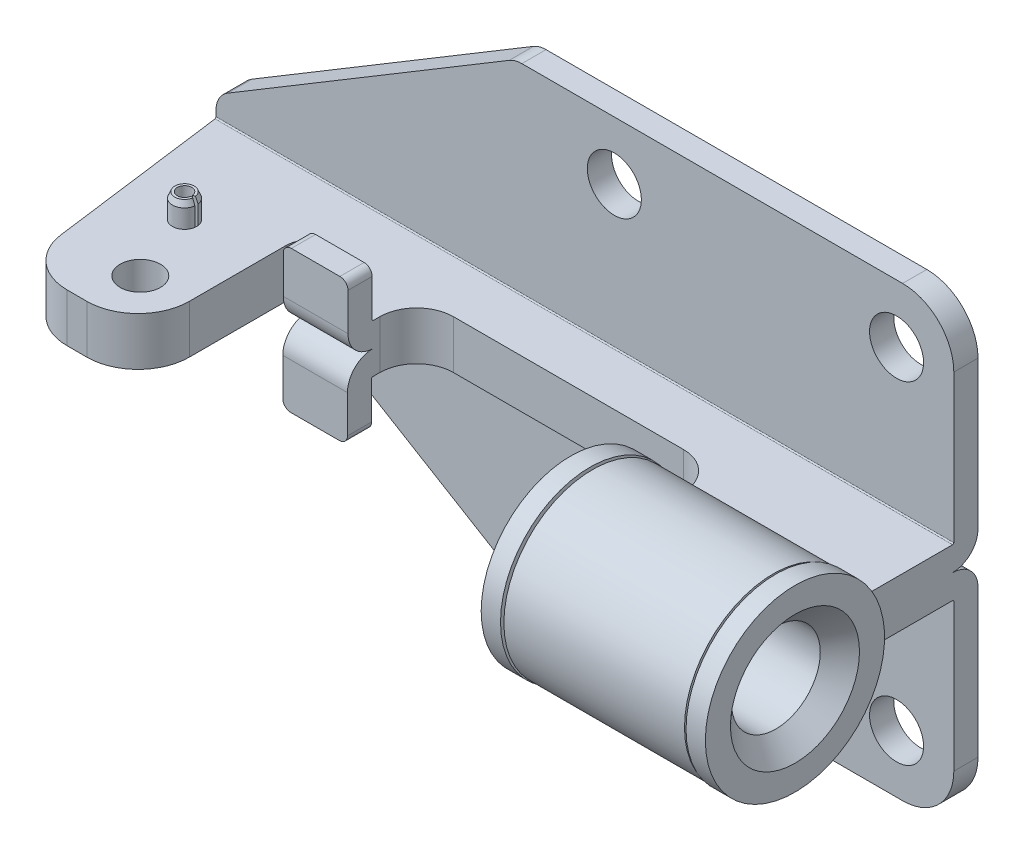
ISO-10303-21;
HEADER;
FILE_DESCRIPTION(('STEP AP214'),'2;1');
FILE_NAME('part.step','',(''),(''),'','','');
FILE_SCHEMA(('AUTOMOTIVE_DESIGN { 1 0 10303 214 1 1 1 1 }'));
ENDSEC;
DATA;
#1=APPLICATION_CONTEXT('core data for automotive mechanical design processes');
#2=APPLICATION_PROTOCOL_DEFINITION('international standard','automotive_design',2000,#1);
#3=PRODUCT_CONTEXT('',#1,'mechanical');
#4=PRODUCT('Part','Part','',(#3));
#5=PRODUCT_RELATED_PRODUCT_CATEGORY('part','',(#4));
#6=PRODUCT_DEFINITION_FORMATION('','',#4);
#7=PRODUCT_DEFINITION_CONTEXT('part definition',#1,'design');
#8=PRODUCT_DEFINITION('design','',#6,#7);
#9=PRODUCT_DEFINITION_SHAPE('','',#8);
#10=(LENGTH_UNIT() NAMED_UNIT(*) SI_UNIT(.MILLI.,.METRE.));
#11=(NAMED_UNIT(*) PLANE_ANGLE_UNIT() SI_UNIT($,.RADIAN.));
#12=(NAMED_UNIT(*) SI_UNIT($,.STERADIAN.) SOLID_ANGLE_UNIT());
#13=UNCERTAINTY_MEASURE_WITH_UNIT(LENGTH_MEASURE(1.E-05),#10,'distance_accuracy_value','');
#14=(GEOMETRIC_REPRESENTATION_CONTEXT(3) GLOBAL_UNCERTAINTY_ASSIGNED_CONTEXT((#13)) GLOBAL_UNIT_ASSIGNED_CONTEXT((#10,
#11,#12)) REPRESENTATION_CONTEXT('',''));
#15=CARTESIAN_POINT('',(0.,0.,0.));
#16=DIRECTION('',(0.,0.,1.));
#17=DIRECTION('',(1.,0.,0.));
#18=AXIS2_PLACEMENT_3D('',#15,#16,#17);
#19=CARTESIAN_POINT('',(-28.648000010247,23.6,12.3296000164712));
#20=DIRECTION('',(0.,1.,0.));
#21=DIRECTION('',(0.,0.,1.));
#22=AXIS2_PLACEMENT_3D('',#19,#20,#21);
#23=PLANE('',#22);
#24=CARTESIAN_POINT('',(-40.45,23.6,15.8496));
#25=DIRECTION('',(0.,-1.,0.));
#26=DIRECTION('',(0.,0.,-1.));
#27=AXIS2_PLACEMENT_3D('',#24,#25,#26);
#28=CIRCLE('',#27,1.5);
#29=CARTESIAN_POINT('',(-38.9645978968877,23.6,15.64084034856));
#30=VERTEX_POINT('',#29);
#31=CARTESIAN_POINT('',(-38.9645978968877,23.6,16.0583596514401));
#32=VERTEX_POINT('',#31);
#33=EDGE_CURVE('E562',#30,#32,#28,.T.);
#34=ORIENTED_EDGE('',*,*,#33,.T.);
#35=CARTESIAN_POINT('',(-40.45,23.6,15.8496));
#36=DIRECTION('',(0.,1.,0.));
#37=DIRECTION('',(0.,0.,1.));
#38=AXIS2_PLACEMENT_3D('',#35,#36,#37);
#39=CIRCLE('',#38,1.5);
#40=EDGE_CURVE('E568',#32,#30,#39,.F.);
#41=ORIENTED_EDGE('',*,*,#40,.T.);
#42=EDGE_LOOP('',(#34,#41));
#43=FACE_BOUND('',#42,.T.);
#44=CARTESIAN_POINT('',(-37.148,23.6,24.638));
#45=DIRECTION('',(0.,1.,0.));
#46=DIRECTION('',(0.,0.,1.));
#47=AXIS2_PLACEMENT_3D('',#44,#45,#46);
#48=CIRCLE('',#47,2.5);
#49=CARTESIAN_POINT('',(-37.148,23.6,27.138));
#50=VERTEX_POINT('',#49);
#51=EDGE_CURVE('E571',#50,#50,#48,.F.);
#52=ORIENTED_EDGE('',*,*,#51,.T.);
#53=EDGE_LOOP('',(#52));
#54=FACE_BOUND('',#53,.T.);
#55=DIRECTION('',(0.,0.,1.));
#56=VECTOR('',#55,1.);
#57=CARTESIAN_POINT('',(19.7,23.6,12.3296000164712));
#58=LINE('',#57,#56);
#59=CARTESIAN_POINT('',(19.7,23.6,13.5208367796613));
#60=VERTEX_POINT('',#59);
#61=CARTESIAN_POINT('',(19.7,23.6,14.7042064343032));
#62=VERTEX_POINT('',#61);
#63=EDGE_CURVE('E574',#60,#62,#58,.T.);
#64=ORIENTED_EDGE('',*,*,#63,.T.);
#65=DIRECTION('',(1.,0.,0.));
#66=VECTOR('',#65,1.);
#67=CARTESIAN_POINT('',(-28.648000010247,23.6,14.7042064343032));
#68=LINE('',#67,#66);
#69=CARTESIAN_POINT('',(42.1,23.6,14.7042064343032));
#70=VERTEX_POINT('',#69);
#71=EDGE_CURVE('E576',#62,#70,#68,.T.);
#72=ORIENTED_EDGE('',*,*,#71,.T.);
#73=DIRECTION('',(0.,0.,1.));
#74=VECTOR('',#73,1.);
#75=CARTESIAN_POINT('',(42.1,23.6,3.));
#76=LINE('',#75,#74);
#77=CARTESIAN_POINT('',(42.1,23.6,3.15));
#78=VERTEX_POINT('',#77);
#79=EDGE_CURVE('E579',#70,#78,#76,.F.);
#80=ORIENTED_EDGE('',*,*,#79,.T.);
#81=DIRECTION('',(1.,0.,0.));
#82=VECTOR('',#81,1.);
#83=CARTESIAN_POINT('',(-28.648000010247,23.6,3.15));
#84=LINE('',#83,#82);
#85=CARTESIAN_POINT('',(-49.3662695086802,23.6,3.15));
#86=VERTEX_POINT('',#85);
#87=EDGE_CURVE('E582',#78,#86,#84,.F.);
#88=ORIENTED_EDGE('',*,*,#87,.T.);
#89=DIRECTION('',(0.130526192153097,0.,0.991444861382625));
#90=VECTOR('',#89,1.);
#91=CARTESIAN_POINT('',(-49.3662695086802,23.6,3.15));
#92=LINE('',#91,#90);
#93=CARTESIAN_POINT('',(-46.4672234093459,23.6,25.1704413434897));
#94=VERTEX_POINT('',#93);
#95=EDGE_CURVE('E585',#86,#94,#92,.T.);
#96=ORIENTED_EDGE('',*,*,#95,.T.);
#97=CARTESIAN_POINT('',(-40.1715485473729,23.6,24.3416000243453));
#98=DIRECTION('',(0.,-1.,0.));
#99=DIRECTION('',(0.,0.,-1.));
#100=AXIS2_PLACEMENT_3D('',#97,#98,#99);
#101=CIRCLE('',#100,6.34999999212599);
#102=CARTESIAN_POINT('',(-40.1715485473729,23.6,30.6916000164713));
#103=VERTEX_POINT('',#102);
#104=EDGE_CURVE('E588',#94,#103,#101,.F.);
#105=ORIENTED_EDGE('',*,*,#104,.T.);
#106=DIRECTION('',(1.,0.,0.));
#107=VECTOR('',#106,1.);
#108=CARTESIAN_POINT('',(-28.648000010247,23.6,30.6916000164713));
#109=LINE('',#108,#107);
#110=CARTESIAN_POINT('',(-37.718000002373,23.6,30.6916000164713));
#111=VERTEX_POINT('',#110);
#112=EDGE_CURVE('E591',#103,#111,#109,.T.);
#113=ORIENTED_EDGE('',*,*,#112,.T.);
#114=CARTESIAN_POINT('',(-37.718000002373,23.6,24.3416000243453));
#115=DIRECTION('',(0.,-1.,0.));
#116=DIRECTION('',(0.,0.,-1.));
#117=AXIS2_PLACEMENT_3D('',#114,#115,#116);
#118=CIRCLE('',#117,6.349999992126);
#119=CARTESIAN_POINT('',(-31.3680000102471,23.6,24.3416000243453));
#120=VERTEX_POINT('',#119);
#121=EDGE_CURVE('E594',#111,#120,#118,.F.);
#122=ORIENTED_EDGE('',*,*,#121,.T.);
#123=DIRECTION('',(0.,0.,1.));
#124=VECTOR('',#123,1.);
#125=CARTESIAN_POINT('',(-31.3680000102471,23.6,12.3296000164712));
#126=LINE('',#125,#124);
#127=CARTESIAN_POINT('',(-31.3680000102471,23.6,12.3296000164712));
#128=VERTEX_POINT('',#127);
#129=EDGE_CURVE('E251',#120,#128,#126,.F.);
#130=ORIENTED_EDGE('',*,*,#129,.T.);
#131=CARTESIAN_POINT('',(-28.648000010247,23.6,12.3296000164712));
#132=DIRECTION('',(0.,-1.,0.));
#133=DIRECTION('',(0.,0.,-1.));
#134=AXIS2_PLACEMENT_3D('',#131,#132,#133);
#135=CIRCLE('',#134,2.72);
#136=CARTESIAN_POINT('',(-25.9280000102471,23.6,12.3296000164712));
#137=VERTEX_POINT('',#136);
#138=EDGE_CURVE('E234',#128,#137,#135,.T.);
#139=ORIENTED_EDGE('',*,*,#138,.T.);
#140=DIRECTION('',(0.,0.,1.));
#141=VECTOR('',#140,1.);
#142=CARTESIAN_POINT('',(-25.9280000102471,23.6,13.6528854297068));
#143=LINE('',#142,#141);
#144=CARTESIAN_POINT('',(-25.9280000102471,23.6,14.9761708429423));
#145=VERTEX_POINT('',#144);
#146=EDGE_CURVE('E167',#137,#145,#143,.T.);
#147=ORIENTED_EDGE('',*,*,#146,.T.);
#148=DIRECTION('',(1.,0.,0.));
#149=VECTOR('',#148,1.);
#150=CARTESIAN_POINT('',(-28.648000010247,23.6,14.9761708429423));
#151=LINE('',#150,#149);
#152=CARTESIAN_POINT('',(-17.905973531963,23.6,14.9761708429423));
#153=VERTEX_POINT('',#152);
#154=EDGE_CURVE('E225',#145,#153,#151,.T.);
#155=ORIENTED_EDGE('',*,*,#154,.T.);
#156=DIRECTION('',(0.,0.,1.));
#157=VECTOR('',#156,1.);
#158=CARTESIAN_POINT('',(-17.9059735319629,23.6,14.5789500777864));
#159=LINE('',#158,#157);
#160=CARTESIAN_POINT('',(-17.905973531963,23.6,14.1817293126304));
#161=VERTEX_POINT('',#160);
#162=EDGE_CURVE('E159',#161,#153,#159,.T.);
#163=ORIENTED_EDGE('',*,*,#162,.F.);
#164=CARTESIAN_POINT('',(-13.3338442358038,23.6,14.1817293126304));
#165=DIRECTION('',(0.,-1.,0.));
#166=DIRECTION('',(0.,0.,-1.));
#167=AXIS2_PLACEMENT_3D('',#164,#165,#166);
#168=CIRCLE('',#167,4.57212929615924);
#169=CARTESIAN_POINT('',(-13.3338442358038,23.6,9.60960001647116));
#170=VERTEX_POINT('',#169);
#171=EDGE_CURVE('E223',#161,#170,#168,.T.);
#172=ORIENTED_EDGE('',*,*,#171,.T.);
#173=DIRECTION('',(1.,0.,0.));
#174=VECTOR('',#173,1.);
#175=CARTESIAN_POINT('',(-28.648000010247,23.6,9.60960001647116));
#176=LINE('',#175,#174);
#177=CARTESIAN_POINT('',(15.1760000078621,23.6,9.60960001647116));
#178=VERTEX_POINT('',#177);
#179=EDGE_CURVE('E230',#170,#178,#176,.T.);
#180=ORIENTED_EDGE('',*,*,#179,.T.);
#181=CARTESIAN_POINT('',(15.1760000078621,23.6,14.1816000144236));
#182=DIRECTION('',(0.,-1.,0.));
#183=DIRECTION('',(0.,0.,-1.));
#184=AXIS2_PLACEMENT_3D('',#181,#182,#183);
#185=CIRCLE('',#184,4.57199999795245);
#186=EDGE_CURVE('E232',#178,#60,#185,.T.);
#187=ORIENTED_EDGE('',*,*,#186,.T.);
#188=EDGE_LOOP('',(#64,#72,#80,#88,#96,#105,#113,#122,#130,#139,#147,#155,#163,#172,#180,#187));
#189=FACE_BOUND('',#188,.T.);
#190=ADVANCED_FACE('F16',(#43,#54,#189),#23,.T.);
#191=CARTESIAN_POINT('',(-28.6480000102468,17.6,12.3946000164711));
#192=DIRECTION('',(0.,1.,0.));
#193=DIRECTION('',(0.,0.,1.));
#194=AXIS2_PLACEMENT_3D('',#191,#192,#193);
#195=PLANE('',#194);
#196=CARTESIAN_POINT('',(-40.45,17.6,15.8496));
#197=DIRECTION('',(0.,1.,0.));
#198=DIRECTION('',(0.,0.,1.));
#199=AXIS2_PLACEMENT_3D('',#196,#197,#198);
#200=CIRCLE('',#199,1.5);
#201=CARTESIAN_POINT('',(-38.9645978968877,17.6,16.0583596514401));
#202=VERTEX_POINT('',#201);
#203=CARTESIAN_POINT('',(-38.9645978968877,17.6,15.64084034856));
#204=VERTEX_POINT('',#203);
#205=EDGE_CURVE('E601',#202,#204,#200,.F.);
#206=ORIENTED_EDGE('',*,*,#205,.F.);
#207=CARTESIAN_POINT('',(-40.45,17.6,15.8496));
#208=DIRECTION('',(0.,-1.,0.));
#209=DIRECTION('',(0.,0.,-1.));
#210=AXIS2_PLACEMENT_3D('',#207,#208,#209);
#211=CIRCLE('',#210,1.5);
#212=EDGE_CURVE('E604',#202,#204,#211,.F.);
#213=ORIENTED_EDGE('',*,*,#212,.T.);
#214=EDGE_LOOP('',(#206,#213));
#215=FACE_BOUND('',#214,.T.);
#216=CARTESIAN_POINT('',(-37.148,17.6,24.638));
#217=DIRECTION('',(0.,1.,0.));
#218=DIRECTION('',(0.,0.,1.));
#219=AXIS2_PLACEMENT_3D('',#216,#217,#218);
#220=CIRCLE('',#219,2.5);
#221=CARTESIAN_POINT('',(-37.148,17.6,27.138));
#222=VERTEX_POINT('',#221);
#223=EDGE_CURVE('E607',#222,#222,#220,.F.);
#224=ORIENTED_EDGE('',*,*,#223,.F.);
#225=EDGE_LOOP('',(#224));
#226=FACE_BOUND('',#225,.T.);
#227=DIRECTION('',(0.,0.,1.));
#228=VECTOR('',#227,1.);
#229=CARTESIAN_POINT('',(-31.3680000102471,17.6,12.3946000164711));
#230=LINE('',#229,#228);
#231=CARTESIAN_POINT('',(-31.3680000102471,17.6,24.3416000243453));
#232=VERTEX_POINT('',#231);
#233=CARTESIAN_POINT('',(-31.3680000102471,17.6,12.3296000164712));
#234=VERTEX_POINT('',#233);
#235=EDGE_CURVE('E610',#232,#234,#230,.F.);
#236=ORIENTED_EDGE('',*,*,#235,.F.);
#237=CARTESIAN_POINT('',(-37.718000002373,17.6,24.3416000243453));
#238=DIRECTION('',(0.,-1.,0.));
#239=DIRECTION('',(0.,0.,-1.));
#240=AXIS2_PLACEMENT_3D('',#237,#238,#239);
#241=CIRCLE('',#240,6.349999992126);
#242=CARTESIAN_POINT('',(-37.718000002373,17.6,30.6916000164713));
#243=VERTEX_POINT('',#242);
#244=EDGE_CURVE('E613',#243,#232,#241,.F.);
#245=ORIENTED_EDGE('',*,*,#244,.F.);
#246=DIRECTION('',(1.,0.,0.));
#247=VECTOR('',#246,1.);
#248=CARTESIAN_POINT('',(-28.6480000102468,17.6,30.6916000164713));
#249=LINE('',#248,#247);
#250=CARTESIAN_POINT('',(-40.1715485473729,17.6,30.6916000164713));
#251=VERTEX_POINT('',#250);
#252=EDGE_CURVE('E616',#251,#243,#249,.T.);
#253=ORIENTED_EDGE('',*,*,#252,.F.);
#254=CARTESIAN_POINT('',(-40.1715485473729,17.6,24.3416000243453));
#255=DIRECTION('',(0.,-1.,0.));
#256=DIRECTION('',(0.,0.,-1.));
#257=AXIS2_PLACEMENT_3D('',#254,#255,#256);
#258=CIRCLE('',#257,6.34999999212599);
#259=CARTESIAN_POINT('',(-46.4672234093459,17.6,25.1704413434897));
#260=VERTEX_POINT('',#259);
#261=EDGE_CURVE('E619',#260,#251,#258,.F.);
#262=ORIENTED_EDGE('',*,*,#261,.F.);
#263=DIRECTION('',(0.130526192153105,0.,0.991444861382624));
#264=VECTOR('',#263,1.);
#265=CARTESIAN_POINT('',(-49.3662695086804,17.6,3.15));
#266=LINE('',#265,#264);
#267=CARTESIAN_POINT('',(-49.3662695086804,17.6,3.15));
#268=VERTEX_POINT('',#267);
#269=EDGE_CURVE('E622',#268,#260,#266,.T.);
#270=ORIENTED_EDGE('',*,*,#269,.F.);
#271=DIRECTION('',(1.,0.,0.));
#272=VECTOR('',#271,1.);
#273=CARTESIAN_POINT('',(-28.6480000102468,17.6,3.15));
#274=LINE('',#273,#272);
#275=CARTESIAN_POINT('',(42.1,17.6,3.15));
#276=VERTEX_POINT('',#275);
#277=EDGE_CURVE('E625',#276,#268,#274,.F.);
#278=ORIENTED_EDGE('',*,*,#277,.F.);
#279=DIRECTION('',(0.,0.,1.));
#280=VECTOR('',#279,1.);
#281=CARTESIAN_POINT('',(42.1,17.6,3.));
#282=LINE('',#281,#280);
#283=CARTESIAN_POINT('',(42.1,17.6,14.7042064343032));
#284=VERTEX_POINT('',#283);
#285=EDGE_CURVE('E628',#276,#284,#282,.T.);
#286=ORIENTED_EDGE('',*,*,#285,.T.);
#287=DIRECTION('',(1.,0.,0.));
#288=VECTOR('',#287,1.);
#289=CARTESIAN_POINT('',(-28.6480000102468,17.6,14.7042064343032));
#290=LINE('',#289,#288);
#291=CARTESIAN_POINT('',(19.7,17.6,14.7042064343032));
#292=VERTEX_POINT('',#291);
#293=EDGE_CURVE('E631',#292,#284,#290,.T.);
#294=ORIENTED_EDGE('',*,*,#293,.F.);
#295=DIRECTION('',(0.,0.,1.));
#296=VECTOR('',#295,1.);
#297=CARTESIAN_POINT('',(19.7,17.6,12.3946000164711));
#298=LINE('',#297,#296);
#299=CARTESIAN_POINT('',(19.7,17.6,13.5208367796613));
#300=VERTEX_POINT('',#299);
#301=EDGE_CURVE('E334',#300,#292,#298,.T.);
#302=ORIENTED_EDGE('',*,*,#301,.F.);
#303=CARTESIAN_POINT('',(15.1760000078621,17.6,14.1816000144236));
#304=DIRECTION('',(0.,-1.,0.));
#305=DIRECTION('',(0.,0.,-1.));
#306=AXIS2_PLACEMENT_3D('',#303,#304,#305);
#307=CIRCLE('',#306,4.57199999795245);
#308=CARTESIAN_POINT('',(15.1760000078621,17.6,9.60960001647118));
#309=VERTEX_POINT('',#308);
#310=EDGE_CURVE('E326',#309,#300,#307,.T.);
#311=ORIENTED_EDGE('',*,*,#310,.F.);
#312=DIRECTION('',(1.,0.,0.));
#313=VECTOR('',#312,1.);
#314=CARTESIAN_POINT('',(-28.6480000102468,17.6,9.60960001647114));
#315=LINE('',#314,#313);
#316=CARTESIAN_POINT('',(-13.3338442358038,17.6,9.60960001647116));
#317=VERTEX_POINT('',#316);
#318=EDGE_CURVE('E323',#317,#309,#315,.T.);
#319=ORIENTED_EDGE('',*,*,#318,.F.);
#320=CARTESIAN_POINT('',(-13.3338442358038,17.6,14.1817293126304));
#321=DIRECTION('',(0.,-1.,0.));
#322=DIRECTION('',(0.,0.,-1.));
#323=AXIS2_PLACEMENT_3D('',#320,#321,#322);
#324=CIRCLE('',#323,4.57212929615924);
#325=CARTESIAN_POINT('',(-17.905973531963,17.6,14.1817293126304));
#326=VERTEX_POINT('',#325);
#327=EDGE_CURVE('E237',#326,#317,#324,.T.);
#328=ORIENTED_EDGE('',*,*,#327,.F.);
#329=DIRECTION('',(0.,0.,1.));
#330=VECTOR('',#329,1.);
#331=CARTESIAN_POINT('',(-17.9059735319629,17.6,14.6114500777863));
#332=LINE('',#331,#330);
#333=CARTESIAN_POINT('',(-17.9059735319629,17.6,15.0411708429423));
#334=VERTEX_POINT('',#333);
#335=EDGE_CURVE('E209',#326,#334,#332,.T.);
#336=ORIENTED_EDGE('',*,*,#335,.T.);
#337=DIRECTION('',(1.,0.,0.));
#338=VECTOR('',#337,1.);
#339=CARTESIAN_POINT('',(-28.6480000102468,17.6,15.0411708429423));
#340=LINE('',#339,#338);
#341=CARTESIAN_POINT('',(-25.9280000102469,17.6,15.0411708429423));
#342=VERTEX_POINT('',#341);
#343=EDGE_CURVE('E255',#342,#334,#340,.T.);
#344=ORIENTED_EDGE('',*,*,#343,.F.);
#345=DIRECTION('',(0.,0.,1.));
#346=VECTOR('',#345,1.);
#347=CARTESIAN_POINT('',(-25.9280000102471,17.6,13.6853854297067));
#348=LINE('',#347,#346);
#349=CARTESIAN_POINT('',(-25.9280000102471,17.6,12.3296000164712));
#350=VERTEX_POINT('',#349);
#351=EDGE_CURVE('E171',#350,#342,#348,.T.);
#352=ORIENTED_EDGE('',*,*,#351,.F.);
#353=CARTESIAN_POINT('',(-28.648000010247,17.6,12.3296000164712));
#354=DIRECTION('',(0.,-1.,0.));
#355=DIRECTION('',(0.,0.,-1.));
#356=AXIS2_PLACEMENT_3D('',#353,#354,#355);
#357=CIRCLE('',#356,2.72);
#358=EDGE_CURVE('E252',#234,#350,#357,.T.);
#359=ORIENTED_EDGE('',*,*,#358,.F.);
#360=EDGE_LOOP('',(#236,#245,#253,#262,#270,#278,#286,#294,#302,#311,#319,#328,#336,#344,#352,#359));
#361=FACE_BOUND('',#360,.T.);
#362=ADVANCED_FACE('F1394',(#215,#226,#361),#195,.F.);
#363=CARTESIAN_POINT('',(-13.3338442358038,23.6,14.1817293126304));
#364=DIRECTION('',(0.,-1.,0.));
#365=DIRECTION('',(0.,0.,-1.));
#366=AXIS2_PLACEMENT_3D('',#363,#364,#365);
#367=CYLINDRICAL_SURFACE('',#366,4.57212929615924);
#368=ORIENTED_EDGE('',*,*,#327,.T.);
#369=DIRECTION('',(0.,1.,0.));
#370=VECTOR('',#369,1.);
#371=CARTESIAN_POINT('',(-13.3338442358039,23.6,9.60960001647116));
#372=LINE('',#371,#370);
#373=EDGE_CURVE('E229',#317,#170,#372,.T.);
#374=ORIENTED_EDGE('',*,*,#373,.T.);
#375=ORIENTED_EDGE('',*,*,#171,.F.);
#376=DIRECTION('',(0.,-1.,0.));
#377=VECTOR('',#376,1.);
#378=CARTESIAN_POINT('',(-17.9059735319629,20.6,14.1817293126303));
#379=LINE('',#378,#377);
#380=EDGE_CURVE('E210',#161,#326,#379,.T.);
#381=ORIENTED_EDGE('',*,*,#380,.T.);
#382=EDGE_LOOP('',(#368,#374,#375,#381));
#383=FACE_BOUND('',#382,.T.);
#384=ADVANCED_FACE('F227',(#383),#367,.F.);
#385=CARTESIAN_POINT('',(-30.5107378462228,17.45,15.0411708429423));
#386=DIRECTION('',(1.,0.,0.));
#387=DIRECTION('',(0.,1.,0.));
#388=AXIS2_PLACEMENT_3D('',#385,#386,#387);
#389=CYLINDRICAL_SURFACE('',#388,0.15);
#390=CARTESIAN_POINT('',(-25.9280000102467,17.45,15.0411708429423));
#391=DIRECTION('',(1.,0.,0.));
#392=DIRECTION('',(0.,1.,0.));
#393=AXIS2_PLACEMENT_3D('',#390,#391,#392);
#394=CIRCLE('',#393,0.15);
#395=CARTESIAN_POINT('',(-25.9280000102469,17.45,15.1911708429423));
#396=VERTEX_POINT('',#395);
#397=EDGE_CURVE('E174',#342,#396,#394,.T.);
#398=ORIENTED_EDGE('',*,*,#397,.F.);
#399=ORIENTED_EDGE('',*,*,#343,.T.);
#400=CARTESIAN_POINT('',(-17.9059735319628,17.45,15.0411708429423));
#401=DIRECTION('',(1.,0.,0.));
#402=DIRECTION('',(0.,1.,0.));
#403=AXIS2_PLACEMENT_3D('',#400,#401,#402);
#404=CIRCLE('',#403,0.15);
#405=CARTESIAN_POINT('',(-17.9059735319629,17.45,15.1911708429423));
#406=VERTEX_POINT('',#405);
#407=EDGE_CURVE('E208',#334,#406,#404,.T.);
#408=ORIENTED_EDGE('',*,*,#407,.T.);
#409=DIRECTION('',(1.,0.,0.));
#410=VECTOR('',#409,1.);
#411=CARTESIAN_POINT('',(-30.5107378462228,17.45,15.1911708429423));
#412=LINE('',#411,#410);
#413=EDGE_CURVE('E315',#396,#406,#412,.T.);
#414=ORIENTED_EDGE('',*,*,#413,.F.);
#415=EDGE_LOOP('',(#398,#399,#408,#414));
#416=FACE_BOUND('',#415,.T.);
#417=ADVANCED_FACE('F1406',(#416),#389,.F.);
#418=CARTESIAN_POINT('',(-28.6480000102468,20.8034291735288,15.1911708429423));
#419=DIRECTION('',(0.,0.,1.));
#420=DIRECTION('',(0.,-1.,0.));
#421=AXIS2_PLACEMENT_3D('',#418,#419,#420);
#422=PLANE('',#421);
#423=ORIENTED_EDGE('',*,*,#413,.T.);
#424=DIRECTION('',(0.,-1.,0.));
#425=VECTOR('',#424,1.);
#426=CARTESIAN_POINT('',(-17.9059735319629,15.1267145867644,15.1911708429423));
#427=LINE('',#426,#425);
#428=CARTESIAN_POINT('',(-17.9059735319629,12.8034291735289,15.1911708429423));
#429=VERTEX_POINT('',#428);
#430=EDGE_CURVE('E206',#406,#429,#427,.T.);
#431=ORIENTED_EDGE('',*,*,#430,.T.);
#432=CARTESIAN_POINT('',(-18.9059735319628,12.8034291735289,15.1911708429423));
#433=DIRECTION('',(0.,0.,-1.));
#434=DIRECTION('',(0.,1.,0.));
#435=AXIS2_PLACEMENT_3D('',#432,#433,#434);
#436=CIRCLE('',#435,1.);
#437=CARTESIAN_POINT('',(-18.9059735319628,11.8034291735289,15.1911708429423));
#438=VERTEX_POINT('',#437);
#439=EDGE_CURVE('E307',#438,#429,#436,.F.);
#440=ORIENTED_EDGE('',*,*,#439,.F.);
#441=DIRECTION('',(1.,0.,0.));
#442=VECTOR('',#441,1.);
#443=CARTESIAN_POINT('',(-28.6480000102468,11.8034291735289,15.1911708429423));
#444=LINE('',#443,#442);
#445=CARTESIAN_POINT('',(-24.9280000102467,11.8034291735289,15.1911708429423));
#446=VERTEX_POINT('',#445);
#447=EDGE_CURVE('E260',#446,#438,#444,.T.);
#448=ORIENTED_EDGE('',*,*,#447,.F.);
#449=CARTESIAN_POINT('',(-24.9280000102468,12.8034291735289,15.1911708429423));
#450=DIRECTION('',(0.,0.,-1.));
#451=DIRECTION('',(0.,1.,0.));
#452=AXIS2_PLACEMENT_3D('',#449,#450,#451);
#453=CIRCLE('',#452,1.);
#454=CARTESIAN_POINT('',(-25.928000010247,12.8034291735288,15.1911708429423));
#455=VERTEX_POINT('',#454);
#456=EDGE_CURVE('E256',#455,#446,#453,.F.);
#457=ORIENTED_EDGE('',*,*,#456,.F.);
#458=DIRECTION('',(0.,1.,0.));
#459=VECTOR('',#458,1.);
#460=CARTESIAN_POINT('',(-25.9280000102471,15.1267145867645,15.1911708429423));
#461=LINE('',#460,#459);
#462=EDGE_CURVE('E175',#455,#396,#461,.T.);
#463=ORIENTED_EDGE('',*,*,#462,.T.);
#464=EDGE_LOOP('',(#423,#431,#440,#448,#457,#463));
#465=FACE_BOUND('',#464,.T.);
#466=ADVANCED_FACE('F1415',(#465),#422,.F.);
#467=CARTESIAN_POINT('',(-24.9280000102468,12.8034291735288,18.1911708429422));
#468=DIRECTION('',(0.,0.,-1.));
#469=DIRECTION('',(0.,1.,0.));
#470=AXIS2_PLACEMENT_3D('',#467,#468,#469);
#471=CYLINDRICAL_SURFACE('',#470,1.);
#472=CARTESIAN_POINT('',(-24.9280000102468,12.8034291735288,18.1911708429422));
#473=DIRECTION('',(0.,0.,-1.));
#474=DIRECTION('',(0.,1.,0.));
#475=AXIS2_PLACEMENT_3D('',#472,#473,#474);
#476=CIRCLE('',#475,1.);
#477=CARTESIAN_POINT('',(-24.9280000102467,11.8034291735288,18.1911708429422));
#478=VERTEX_POINT('',#477);
#479=CARTESIAN_POINT('',(-25.928000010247,12.8034291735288,18.1911706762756));
#480=VERTEX_POINT('',#479);
#481=EDGE_CURVE('E259',#478,#480,#476,.T.);
#482=ORIENTED_EDGE('',*,*,#481,.T.);
#483=DIRECTION('',(0.,0.,1.));
#484=VECTOR('',#483,1.);
#485=CARTESIAN_POINT('',(-25.9280000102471,12.8034291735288,16.6911708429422));
#486=LINE('',#485,#484);
#487=EDGE_CURVE('E177',#455,#480,#486,.T.);
#488=ORIENTED_EDGE('',*,*,#487,.F.);
#489=ORIENTED_EDGE('',*,*,#456,.T.);
#490=DIRECTION('',(0.,0.,-1.));
#491=VECTOR('',#490,1.);
#492=CARTESIAN_POINT('',(-24.9280000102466,11.8034291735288,18.1911708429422));
#493=LINE('',#492,#491);
#494=EDGE_CURVE('E263',#446,#478,#493,.F.);
#495=ORIENTED_EDGE('',*,*,#494,.T.);
#496=EDGE_LOOP('',(#482,#488,#489,#495));
#497=FACE_BOUND('',#496,.T.);
#498=ADVANCED_FACE('F1418',(#497),#471,.T.);
#499=CARTESIAN_POINT('',(-28.6480000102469,20.8034291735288,18.1911708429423));
#500=DIRECTION('',(0.,0.,1.));
#501=DIRECTION('',(0.,-1.,0.));
#502=AXIS2_PLACEMENT_3D('',#499,#500,#501);
#503=PLANE('',#502);
#504=CARTESIAN_POINT('',(-18.9059735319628,12.8034291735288,18.1911708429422));
#505=DIRECTION('',(0.,0.,-1.));
#506=DIRECTION('',(0.,1.,0.));
#507=AXIS2_PLACEMENT_3D('',#504,#505,#506);
#508=CIRCLE('',#507,1.);
#509=CARTESIAN_POINT('',(-18.9059735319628,11.8034291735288,18.1911708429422));
#510=VERTEX_POINT('',#509);
#511=CARTESIAN_POINT('',(-17.9059735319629,12.8034293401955,18.1911708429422));
#512=VERTEX_POINT('',#511);
#513=EDGE_CURVE('E248',#510,#512,#508,.F.);
#514=ORIENTED_EDGE('',*,*,#513,.T.);
#515=DIRECTION('',(0.,-1.,0.));
#516=VECTOR('',#515,1.);
#517=CARTESIAN_POINT('',(-17.9059735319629,15.1267145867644,18.1911708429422));
#518=LINE('',#517,#516);
#519=CARTESIAN_POINT('',(-17.9059735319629,17.45,18.1911708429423));
#520=VERTEX_POINT('',#519);
#521=EDGE_CURVE('E164',#520,#512,#518,.T.);
#522=ORIENTED_EDGE('',*,*,#521,.F.);
#523=DIRECTION('',(1.,0.,0.));
#524=VECTOR('',#523,1.);
#525=CARTESIAN_POINT('',(-28.6480000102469,17.45,18.1911708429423));
#526=LINE('',#525,#524);
#527=CARTESIAN_POINT('',(-25.9280000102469,17.45,18.1911708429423));
#528=VERTEX_POINT('',#527);
#529=EDGE_CURVE('E244',#520,#528,#526,.F.);
#530=ORIENTED_EDGE('',*,*,#529,.T.);
#531=DIRECTION('',(0.,1.,0.));
#532=VECTOR('',#531,1.);
#533=CARTESIAN_POINT('',(-25.9280000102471,15.1267145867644,18.1911708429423));
#534=LINE('',#533,#532);
#535=EDGE_CURVE('E180',#480,#528,#534,.T.);
#536=ORIENTED_EDGE('',*,*,#535,.F.);
#537=ORIENTED_EDGE('',*,*,#481,.F.);
#538=DIRECTION('',(1.,0.,0.));
#539=VECTOR('',#538,1.);
#540=CARTESIAN_POINT('',(-28.6480000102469,11.8034291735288,18.1911708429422));
#541=LINE('',#540,#539);
#542=EDGE_CURVE('E247',#478,#510,#541,.T.);
#543=ORIENTED_EDGE('',*,*,#542,.T.);
#544=EDGE_LOOP('',(#514,#522,#530,#536,#537,#543));
#545=FACE_BOUND('',#544,.T.);
#546=ADVANCED_FACE('F1421',(#545),#503,.T.);
#547=CARTESIAN_POINT('',(-18.9059735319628,12.8034291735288,18.1911708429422));
#548=DIRECTION('',(0.,0.,-1.));
#549=DIRECTION('',(0.,1.,0.));
#550=AXIS2_PLACEMENT_3D('',#547,#548,#549);
#551=CYLINDRICAL_SURFACE('',#550,1.);
#552=ORIENTED_EDGE('',*,*,#513,.F.);
#553=DIRECTION('',(0.,0.,-1.));
#554=VECTOR('',#553,1.);
#555=CARTESIAN_POINT('',(-18.9059735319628,11.8034291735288,18.1911708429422));
#556=LINE('',#555,#554);
#557=EDGE_CURVE('E345',#510,#438,#556,.T.);
#558=ORIENTED_EDGE('',*,*,#557,.T.);
#559=ORIENTED_EDGE('',*,*,#439,.T.);
#560=DIRECTION('',(0.,0.,1.));
#561=VECTOR('',#560,1.);
#562=CARTESIAN_POINT('',(-17.9059735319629,12.8034291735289,16.6911708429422));
#563=LINE('',#562,#561);
#564=EDGE_CURVE('E204',#429,#512,#563,.T.);
#565=ORIENTED_EDGE('',*,*,#564,.T.);
#566=EDGE_LOOP('',(#552,#558,#559,#565));
#567=FACE_BOUND('',#566,.T.);
#568=ADVANCED_FACE('F288',(#567),#551,.T.);
#569=CARTESIAN_POINT('',(-30.5107378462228,17.45,15.0411708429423));
#570=DIRECTION('',(1.,0.,0.));
#571=DIRECTION('',(0.,1.,0.));
#572=AXIS2_PLACEMENT_3D('',#569,#570,#571);
#573=CYLINDRICAL_SURFACE('',#572,3.15);
#574=CARTESIAN_POINT('',(-25.9280000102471,20.6,14.9761708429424));
#575=DIRECTION('',(1.,0.,0.));
#576=VECTOR('',#575,1.);
#577=LINE('',#574,#576);
#578=CARTESIAN_POINT('',(-25.928000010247,20.6001340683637,15.0086756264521));
#579=VERTEX_POINT('',#578);
#580=CARTESIAN_POINT('',(-17.9059737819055,20.6001340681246,15.008675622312));
#581=VERTEX_POINT('',#580);
#582=EDGE_CURVE('E26',#579,#581,#577,.T.);
#583=ORIENTED_EDGE('',*,*,#582,.F.);
#584=CARTESIAN_POINT('',(-25.9280000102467,17.45,15.0411708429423));
#585=DIRECTION('',(1.,0.,0.));
#586=DIRECTION('',(0.,1.,0.));
#587=AXIS2_PLACEMENT_3D('',#584,#585,#586);
#588=CIRCLE('',#587,3.15);
#589=EDGE_CURVE('E182',#579,#528,#588,.T.);
#590=ORIENTED_EDGE('',*,*,#589,.T.);
#591=ORIENTED_EDGE('',*,*,#529,.F.);
#592=CARTESIAN_POINT('',(-17.9059735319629,17.45,15.0411708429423));
#593=DIRECTION('',(1.,0.,0.));
#594=DIRECTION('',(0.,1.,0.));
#595=AXIS2_PLACEMENT_3D('',#592,#593,#594);
#596=CIRCLE('',#595,3.15);
#597=EDGE_CURVE('E166',#581,#520,#596,.T.);
#598=ORIENTED_EDGE('',*,*,#597,.F.);
#599=EDGE_LOOP('',(#583,#590,#591,#598));
#600=FACE_BOUND('',#599,.T.);
#601=ADVANCED_FACE('F277',(#600),#573,.T.);
#602=CARTESIAN_POINT('',(-28.648000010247,23.6,12.3296000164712));
#603=DIRECTION('',(0.,-1.,0.));
#604=DIRECTION('',(0.,0.,-1.));
#605=AXIS2_PLACEMENT_3D('',#602,#603,#604);
#606=CYLINDRICAL_SURFACE('',#605,2.72);
#607=ORIENTED_EDGE('',*,*,#358,.T.);
#608=DIRECTION('',(0.,1.,0.));
#609=VECTOR('',#608,1.);
#610=CARTESIAN_POINT('',(-25.9280000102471,20.6,12.3296000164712));
#611=LINE('',#610,#609);
#612=EDGE_CURVE('E169',#350,#137,#611,.T.);
#613=ORIENTED_EDGE('',*,*,#612,.T.);
#614=ORIENTED_EDGE('',*,*,#138,.F.);
#615=DIRECTION('',(0.,-1.,0.));
#616=VECTOR('',#615,1.);
#617=CARTESIAN_POINT('',(-31.368000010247,23.6,12.3296000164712));
#618=LINE('',#617,#616);
#619=EDGE_CURVE('E240',#234,#128,#618,.F.);
#620=ORIENTED_EDGE('',*,*,#619,.F.);
#621=EDGE_LOOP('',(#607,#613,#614,#620));
#622=FACE_BOUND('',#621,.T.);
#623=ADVANCED_FACE('F287',(#622),#606,.F.);
#624=CARTESIAN_POINT('',(-30.5107378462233,23.75,14.9761708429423));
#625=DIRECTION('',(1.,0.,0.));
#626=DIRECTION('',(0.,0.,-1.));
#627=AXIS2_PLACEMENT_3D('',#624,#625,#626);
#628=CYLINDRICAL_SURFACE('',#627,0.15);
#629=CARTESIAN_POINT('',(-17.905973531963,23.75,14.9761708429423));
#630=DIRECTION('',(1.,0.,0.));
#631=DIRECTION('',(0.,0.,-1.));
#632=AXIS2_PLACEMENT_3D('',#629,#630,#631);
#633=CIRCLE('',#632,0.15);
#634=CARTESIAN_POINT('',(-17.905973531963,23.75,15.1261708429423));
#635=VERTEX_POINT('',#634);
#636=EDGE_CURVE('E157',#635,#153,#633,.T.);
#637=ORIENTED_EDGE('',*,*,#636,.T.);
#638=ORIENTED_EDGE('',*,*,#154,.F.);
#639=CARTESIAN_POINT('',(-25.9280000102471,23.75,14.9761708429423));
#640=DIRECTION('',(1.,0.,0.));
#641=DIRECTION('',(0.,0.,-1.));
#642=AXIS2_PLACEMENT_3D('',#639,#640,#641);
#643=CIRCLE('',#642,0.15);
#644=CARTESIAN_POINT('',(-25.9280000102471,23.75,15.1261708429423));
#645=VERTEX_POINT('',#644);
#646=EDGE_CURVE('E91',#645,#145,#643,.T.);
#647=ORIENTED_EDGE('',*,*,#646,.F.);
#648=DIRECTION('',(1.,0.,0.));
#649=VECTOR('',#648,1.);
#650=CARTESIAN_POINT('',(-30.5107378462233,23.75,15.1261708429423));
#651=LINE('',#650,#649);
#652=EDGE_CURVE('E151',#635,#645,#651,.F.);
#653=ORIENTED_EDGE('',*,*,#652,.F.);
#654=EDGE_LOOP('',(#637,#638,#647,#653));
#655=FACE_BOUND('',#654,.T.);
#656=ADVANCED_FACE('F292',(#655),#628,.F.);
#657=CARTESIAN_POINT('',(-28.6480000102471,20.3965708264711,15.1261708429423));
#658=DIRECTION('',(0.,0.,-1.));
#659=DIRECTION('',(0.,1.,0.));
#660=AXIS2_PLACEMENT_3D('',#657,#658,#659);
#661=PLANE('',#660);
#662=CARTESIAN_POINT('',(-18.9059735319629,28.3965708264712,15.1261708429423));
#663=DIRECTION('',(0.,0.,1.));
#664=DIRECTION('',(0.,-1.,0.));
#665=AXIS2_PLACEMENT_3D('',#662,#663,#664);
#666=CIRCLE('',#665,1.);
#667=CARTESIAN_POINT('',(-18.9059735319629,29.3965708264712,15.1261708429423));
#668=VERTEX_POINT('',#667);
#669=CARTESIAN_POINT('',(-17.9059735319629,28.3965708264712,15.1261708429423));
#670=VERTEX_POINT('',#669);
#671=EDGE_CURVE('E138',#668,#670,#666,.F.);
#672=ORIENTED_EDGE('',*,*,#671,.T.);
#673=DIRECTION('',(0.,-1.,0.));
#674=VECTOR('',#673,1.);
#675=CARTESIAN_POINT('',(-17.9059735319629,26.0732854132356,15.1261708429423));
#676=LINE('',#675,#674);
#677=EDGE_CURVE('E128',#670,#635,#676,.T.);
#678=ORIENTED_EDGE('',*,*,#677,.T.);
#679=ORIENTED_EDGE('',*,*,#652,.T.);
#680=DIRECTION('',(0.,1.,0.));
#681=VECTOR('',#680,1.);
#682=CARTESIAN_POINT('',(-25.9280000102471,26.0732854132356,15.1261708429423));
#683=LINE('',#682,#681);
#684=CARTESIAN_POINT('',(-25.9280000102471,28.3965706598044,15.1261708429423));
#685=VERTEX_POINT('',#684);
#686=EDGE_CURVE('E20',#645,#685,#683,.T.);
#687=ORIENTED_EDGE('',*,*,#686,.T.);
#688=CARTESIAN_POINT('',(-24.9280000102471,28.3965708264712,15.1261708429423));
#689=DIRECTION('',(0.,0.,1.));
#690=DIRECTION('',(0.,-1.,0.));
#691=AXIS2_PLACEMENT_3D('',#688,#689,#690);
#692=CIRCLE('',#691,1.);
#693=CARTESIAN_POINT('',(-24.9280000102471,29.3965708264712,15.1261708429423));
#694=VERTEX_POINT('',#693);
#695=EDGE_CURVE('E150',#685,#694,#692,.F.);
#696=ORIENTED_EDGE('',*,*,#695,.T.);
#697=DIRECTION('',(1.,0.,0.));
#698=VECTOR('',#697,1.);
#699=CARTESIAN_POINT('',(-28.6480000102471,29.3965708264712,15.1261708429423));
#700=LINE('',#699,#698);
#701=EDGE_CURVE('E148',#694,#668,#700,.T.);
#702=ORIENTED_EDGE('',*,*,#701,.T.);
#703=EDGE_LOOP('',(#672,#678,#679,#687,#696,#702));
#704=FACE_BOUND('',#703,.T.);
#705=ADVANCED_FACE('F145',(#704),#661,.T.);
#706=CARTESIAN_POINT('',(-28.6480000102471,20.3965708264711,18.1261708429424));
#707=DIRECTION('',(0.,0.,-1.));
#708=DIRECTION('',(0.,1.,0.));
#709=AXIS2_PLACEMENT_3D('',#706,#707,#708);
#710=PLANE('',#709);
#711=CARTESIAN_POINT('',(-25.9280000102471,23.75,18.1261708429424));
#712=DIRECTION('',(1.,0.,0.));
#713=VECTOR('',#712,1.);
#714=LINE('',#711,#713);
#715=CARTESIAN_POINT('',(-25.9280000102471,23.75,18.1261708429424));
#716=VERTEX_POINT('',#715);
#717=CARTESIAN_POINT('',(-17.905973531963,23.75,18.1261708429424));
#718=VERTEX_POINT('',#717);
#719=EDGE_CURVE('E35',#716,#718,#714,.T.);
#720=ORIENTED_EDGE('',*,*,#719,.T.);
#721=CARTESIAN_POINT('',(-17.9059735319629,28.3965708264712,18.1261708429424));
#722=CARTESIAN_POINT('',(-17.9059735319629,23.75,18.1261708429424));
#723=B_SPLINE_CURVE_WITH_KNOTS('',1,(#721,#722),.UNSPECIFIED.,.F.,.F.,(2,2),(0.,1.),.UNSPECIFIED.);
#724=CARTESIAN_POINT('',(-17.9059735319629,28.3965708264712,18.1261706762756));
#725=VERTEX_POINT('',#724);
#726=EDGE_CURVE('E143',#725,#718,#723,.T.);
#727=ORIENTED_EDGE('',*,*,#726,.F.);
#728=CARTESIAN_POINT('',(-18.9059735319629,28.3965708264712,18.1261708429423));
#729=DIRECTION('',(0.,0.,1.));
#730=DIRECTION('',(0.,-1.,0.));
#731=AXIS2_PLACEMENT_3D('',#728,#729,#730);
#732=CIRCLE('',#731,1.);
#733=CARTESIAN_POINT('',(-18.9059735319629,29.3965708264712,18.1261708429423));
#734=VERTEX_POINT('',#733);
#735=EDGE_CURVE('E141',#734,#725,#732,.F.);
#736=ORIENTED_EDGE('',*,*,#735,.F.);
#737=DIRECTION('',(1.,0.,0.));
#738=VECTOR('',#737,1.);
#739=CARTESIAN_POINT('',(-28.6480000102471,29.3965708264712,18.1261708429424));
#740=LINE('',#739,#738);
#741=CARTESIAN_POINT('',(-24.9280000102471,29.3965708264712,18.1261708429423));
#742=VERTEX_POINT('',#741);
#743=EDGE_CURVE('E243',#742,#734,#740,.T.);
#744=ORIENTED_EDGE('',*,*,#743,.F.);
#745=CARTESIAN_POINT('',(-24.9280000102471,28.3965708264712,18.1261708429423));
#746=DIRECTION('',(0.,0.,1.));
#747=DIRECTION('',(0.,-1.,0.));
#748=AXIS2_PLACEMENT_3D('',#745,#746,#747);
#749=CIRCLE('',#748,1.);
#750=CARTESIAN_POINT('',(-25.9280000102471,28.3965706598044,18.1261708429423));
#751=VERTEX_POINT('',#750);
#752=EDGE_CURVE('E264',#751,#742,#749,.F.);
#753=ORIENTED_EDGE('',*,*,#752,.F.);
#754=CARTESIAN_POINT('',(-25.9280000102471,23.75,18.1261708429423));
#755=CARTESIAN_POINT('',(-25.9280000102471,28.3965708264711,18.1261708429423));
#756=B_SPLINE_CURVE_WITH_KNOTS('',1,(#754,#755),.UNSPECIFIED.,.F.,.F.,(2,2),(0.,1.),.UNSPECIFIED.);
#757=EDGE_CURVE('E184',#716,#751,#756,.T.);
#758=ORIENTED_EDGE('',*,*,#757,.F.);
#759=EDGE_LOOP('',(#720,#727,#736,#744,#753,#758));
#760=FACE_BOUND('',#759,.T.);
#761=ADVANCED_FACE('F298',(#760),#710,.F.);
#762=CARTESIAN_POINT('',(-18.9059735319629,28.3965708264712,15.1261708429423));
#763=DIRECTION('',(0.,0.,1.));
#764=DIRECTION('',(0.,-1.,0.));
#765=AXIS2_PLACEMENT_3D('',#762,#763,#764);
#766=CYLINDRICAL_SURFACE('',#765,1.);
#767=ORIENTED_EDGE('',*,*,#671,.F.);
#768=DIRECTION('',(0.,0.,1.));
#769=VECTOR('',#768,1.);
#770=CARTESIAN_POINT('',(-18.9059735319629,29.3965708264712,15.1261708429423));
#771=LINE('',#770,#769);
#772=EDGE_CURVE('E266',#668,#734,#771,.T.);
#773=ORIENTED_EDGE('',*,*,#772,.T.);
#774=ORIENTED_EDGE('',*,*,#735,.T.);
#775=DIRECTION('',(0.,0.,1.));
#776=VECTOR('',#775,1.);
#777=CARTESIAN_POINT('',(-17.9059735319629,28.3965708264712,16.6261708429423));
#778=LINE('',#777,#776);
#779=EDGE_CURVE('E134',#670,#725,#778,.T.);
#780=ORIENTED_EDGE('',*,*,#779,.F.);
#781=EDGE_LOOP('',(#767,#773,#774,#780));
#782=FACE_BOUND('',#781,.T.);
#783=ADVANCED_FACE('F135',(#782),#766,.T.);
#784=CARTESIAN_POINT('',(-24.9280000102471,28.3965708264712,15.1261708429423));
#785=DIRECTION('',(0.,0.,1.));
#786=DIRECTION('',(0.,-1.,0.));
#787=AXIS2_PLACEMENT_3D('',#784,#785,#786);
#788=CYLINDRICAL_SURFACE('',#787,1.);
#789=ORIENTED_EDGE('',*,*,#695,.F.);
#790=DIRECTION('',(0.,0.,1.));
#791=VECTOR('',#790,1.);
#792=CARTESIAN_POINT('',(-25.9280000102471,28.3965708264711,16.6261708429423));
#793=LINE('',#792,#791);
#794=EDGE_CURVE('E183',#685,#751,#793,.T.);
#795=ORIENTED_EDGE('',*,*,#794,.T.);
#796=ORIENTED_EDGE('',*,*,#752,.T.);
#797=DIRECTION('',(0.,0.,1.));
#798=VECTOR('',#797,1.);
#799=CARTESIAN_POINT('',(-24.9280000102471,29.3965708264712,15.1261708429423));
#800=LINE('',#799,#798);
#801=EDGE_CURVE('E354',#742,#694,#800,.F.);
#802=ORIENTED_EDGE('',*,*,#801,.T.);
#803=EDGE_LOOP('',(#789,#795,#796,#802));
#804=FACE_BOUND('',#803,.T.);
#805=ADVANCED_FACE('F1453',(#804),#788,.T.);
#806=CARTESIAN_POINT('',(-24.9280000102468,11.8034291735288,18.1911708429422));
#807=DIRECTION('',(0.,1.,0.));
#808=DIRECTION('',(0.,0.,1.));
#809=AXIS2_PLACEMENT_3D('',#806,#807,#808);
#810=PLANE('',#809);
#811=ORIENTED_EDGE('',*,*,#557,.F.);
#812=ORIENTED_EDGE('',*,*,#542,.F.);
#813=ORIENTED_EDGE('',*,*,#494,.F.);
#814=ORIENTED_EDGE('',*,*,#447,.T.);
#815=EDGE_LOOP('',(#811,#812,#813,#814));
#816=FACE_BOUND('',#815,.T.);
#817=ADVANCED_FACE('F1450',(#816),#810,.F.);
#818=CARTESIAN_POINT('',(-24.9280000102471,29.3965708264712,15.1261708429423));
#819=DIRECTION('',(0.,-1.,0.));
#820=DIRECTION('',(0.,0.,-1.));
#821=AXIS2_PLACEMENT_3D('',#818,#819,#820);
#822=PLANE('',#821);
#823=ORIENTED_EDGE('',*,*,#772,.F.);
#824=ORIENTED_EDGE('',*,*,#701,.F.);
#825=ORIENTED_EDGE('',*,*,#801,.F.);
#826=ORIENTED_EDGE('',*,*,#743,.T.);
#827=EDGE_LOOP('',(#823,#824,#825,#826));
#828=FACE_BOUND('',#827,.T.);
#829=ADVANCED_FACE('F1452',(#828),#822,.F.);
#830=CARTESIAN_POINT('',(-31.3680000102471,23.6,24.3416000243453));
#831=DIRECTION('',(-1.,0.,0.));
#832=DIRECTION('',(0.,0.,1.));
#833=AXIS2_PLACEMENT_3D('',#830,#831,#832);
#834=PLANE('',#833);
#835=ORIENTED_EDGE('',*,*,#619,.T.);
#836=ORIENTED_EDGE('',*,*,#129,.F.);
#837=DIRECTION('',(0.,1.,0.));
#838=VECTOR('',#837,1.);
#839=CARTESIAN_POINT('',(-31.3680000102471,23.6,24.3416000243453));
#840=LINE('',#839,#838);
#841=EDGE_CURVE('E357',#232,#120,#840,.T.);
#842=ORIENTED_EDGE('',*,*,#841,.F.);
#843=ORIENTED_EDGE('',*,*,#235,.T.);
#844=EDGE_LOOP('',(#835,#836,#842,#843));
#845=FACE_BOUND('',#844,.T.);
#846=ADVANCED_FACE('F1460',(#845),#834,.F.);
#847=CARTESIAN_POINT('',(-13.3338442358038,23.6,9.60960001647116));
#848=DIRECTION('',(0.,0.,-1.));
#849=DIRECTION('',(0.,1.,0.));
#850=AXIS2_PLACEMENT_3D('',#847,#848,#849);
#851=PLANE('',#850);
#852=ORIENTED_EDGE('',*,*,#318,.T.);
#853=DIRECTION('',(0.,-1.,0.));
#854=VECTOR('',#853,1.);
#855=CARTESIAN_POINT('',(15.1760000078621,23.6,9.60960001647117));
#856=LINE('',#855,#854);
#857=EDGE_CURVE('E360',#309,#178,#856,.F.);
#858=ORIENTED_EDGE('',*,*,#857,.T.);
#859=ORIENTED_EDGE('',*,*,#179,.F.);
#860=ORIENTED_EDGE('',*,*,#373,.F.);
#861=EDGE_LOOP('',(#852,#858,#859,#860));
#862=FACE_BOUND('',#861,.T.);
#863=ADVANCED_FACE('F1466',(#862),#851,.F.);
#864=CARTESIAN_POINT('',(-40.45,14.6,15.8496));
#865=DIRECTION('',(0.,1.,0.));
#866=DIRECTION('',(0.,0.,1.));
#867=AXIS2_PLACEMENT_3D('',#864,#865,#866);
#868=CYLINDRICAL_SURFACE('',#867,1.5);
#869=DIRECTION('',(0.,1.,0.));
#870=VECTOR('',#869,1.);
#871=CARTESIAN_POINT('',(-38.9645978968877,14.6,15.64084034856));
#872=LINE('',#871,#870);
#873=CARTESIAN_POINT('',(-38.9645978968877,15.3,15.64084034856));
#874=VERTEX_POINT('',#873);
#875=EDGE_CURVE('E362',#204,#874,#872,.F.);
#876=ORIENTED_EDGE('',*,*,#875,.T.);
#877=CARTESIAN_POINT('',(-40.45,15.3,15.8496));
#878=DIRECTION('',(0.,1.,0.));
#879=DIRECTION('',(0.,0.,1.));
#880=AXIS2_PLACEMENT_3D('',#877,#878,#879);
#881=CIRCLE('',#880,1.5);
#882=CARTESIAN_POINT('',(-38.9645978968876,15.3,16.0583596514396));
#883=VERTEX_POINT('',#882);
#884=EDGE_CURVE('E365',#874,#883,#881,.T.);
#885=ORIENTED_EDGE('',*,*,#884,.T.);
#886=DIRECTION('',(0.,1.,0.));
#887=VECTOR('',#886,1.);
#888=CARTESIAN_POINT('',(-38.9645978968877,14.6,16.0583596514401));
#889=LINE('',#888,#887);
#890=EDGE_CURVE('E368',#883,#202,#889,.T.);
#891=ORIENTED_EDGE('',*,*,#890,.T.);
#892=ORIENTED_EDGE('',*,*,#205,.T.);
#893=EDGE_LOOP('',(#876,#885,#891,#892));
#894=FACE_BOUND('',#893,.T.);
#895=ADVANCED_FACE('F1470',(#894),#868,.T.);
#896=CARTESIAN_POINT('',(-40.45,27.6,15.8496));
#897=DIRECTION('',(0.,-1.,0.));
#898=DIRECTION('',(0.,0.,-1.));
#899=AXIS2_PLACEMENT_3D('',#896,#897,#898);
#900=CYLINDRICAL_SURFACE('',#899,1.5);
#901=DIRECTION('',(0.,1.,0.));
#902=VECTOR('',#901,1.);
#903=CARTESIAN_POINT('',(-38.9645978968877,14.6,15.6408403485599));
#904=LINE('',#903,#902);
#905=EDGE_CURVE('E371',#204,#30,#904,.T.);
#906=ORIENTED_EDGE('',*,*,#905,.F.);
#907=ORIENTED_EDGE('',*,*,#212,.F.);
#908=DIRECTION('',(0.,1.,0.));
#909=VECTOR('',#908,1.);
#910=CARTESIAN_POINT('',(-38.9645978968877,14.6,16.0583596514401));
#911=LINE('',#910,#909);
#912=EDGE_CURVE('E374',#32,#202,#911,.F.);
#913=ORIENTED_EDGE('',*,*,#912,.F.);
#914=ORIENTED_EDGE('',*,*,#33,.F.);
#915=EDGE_LOOP('',(#906,#907,#913,#914));
#916=FACE_BOUND('',#915,.T.);
#917=ADVANCED_FACE('F1473',(#916),#900,.F.);
#918=CARTESIAN_POINT('',(-37.148,13.6,24.638));
#919=DIRECTION('',(0.,1.,0.));
#920=DIRECTION('',(0.,0.,1.));
#921=AXIS2_PLACEMENT_3D('',#918,#919,#920);
#922=CYLINDRICAL_SURFACE('',#921,2.5);
#923=ORIENTED_EDGE('',*,*,#51,.F.);
#924=EDGE_LOOP('',(#923));
#925=FACE_BOUND('',#924,.T.);
#926=ORIENTED_EDGE('',*,*,#223,.T.);
#927=EDGE_LOOP('',(#926));
#928=FACE_BOUND('',#927,.T.);
#929=ADVANCED_FACE('F1477',(#925,#928),#922,.F.);
#930=CARTESIAN_POINT('',(-37.718000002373,23.6,24.3416000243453));
#931=DIRECTION('',(0.,-1.,0.));
#932=DIRECTION('',(0.,0.,-1.));
#933=AXIS2_PLACEMENT_3D('',#930,#931,#932);
#934=CYLINDRICAL_SURFACE('',#933,6.349999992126);
#935=ORIENTED_EDGE('',*,*,#841,.T.);
#936=ORIENTED_EDGE('',*,*,#121,.F.);
#937=DIRECTION('',(0.,-1.,0.));
#938=VECTOR('',#937,1.);
#939=CARTESIAN_POINT('',(-37.718000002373,23.6,30.6916000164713));
#940=LINE('',#939,#938);
#941=EDGE_CURVE('E377',#111,#243,#940,.T.);
#942=ORIENTED_EDGE('',*,*,#941,.T.);
#943=ORIENTED_EDGE('',*,*,#244,.T.);
#944=EDGE_LOOP('',(#935,#936,#942,#943));
#945=FACE_BOUND('',#944,.T.);
#946=ADVANCED_FACE('F1481',(#945),#934,.T.);
#947=CARTESIAN_POINT('',(-40.1715485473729,23.6,30.6916000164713));
#948=DIRECTION('',(0.,0.,-1.));
#949=DIRECTION('',(0.,1.,0.));
#950=AXIS2_PLACEMENT_3D('',#947,#948,#949);
#951=PLANE('',#950);
#952=ORIENTED_EDGE('',*,*,#252,.T.);
#953=ORIENTED_EDGE('',*,*,#941,.F.);
#954=ORIENTED_EDGE('',*,*,#112,.F.);
#955=DIRECTION('',(0.,1.,0.));
#956=VECTOR('',#955,1.);
#957=CARTESIAN_POINT('',(-40.1715485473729,23.6,30.6916000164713));
#958=LINE('',#957,#956);
#959=EDGE_CURVE('E380',#251,#103,#958,.T.);
#960=ORIENTED_EDGE('',*,*,#959,.F.);
#961=EDGE_LOOP('',(#952,#953,#954,#960));
#962=FACE_BOUND('',#961,.T.);
#963=ADVANCED_FACE('F1485',(#962),#951,.F.);
#964=CARTESIAN_POINT('',(-40.1715485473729,23.6,24.3416000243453));
#965=DIRECTION('',(0.,-1.,0.));
#966=DIRECTION('',(0.,0.,-1.));
#967=AXIS2_PLACEMENT_3D('',#964,#965,#966);
#968=CYLINDRICAL_SURFACE('',#967,6.34999999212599);
#969=ORIENTED_EDGE('',*,*,#959,.T.);
#970=ORIENTED_EDGE('',*,*,#104,.F.);
#971=DIRECTION('',(0.,1.,0.));
#972=VECTOR('',#971,1.);
#973=CARTESIAN_POINT('',(-46.4672234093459,23.6,25.1704413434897));
#974=LINE('',#973,#972);
#975=EDGE_CURVE('E383',#94,#260,#974,.F.);
#976=ORIENTED_EDGE('',*,*,#975,.T.);
#977=ORIENTED_EDGE('',*,*,#261,.T.);
#978=EDGE_LOOP('',(#969,#970,#976,#977));
#979=FACE_BOUND('',#978,.T.);
#980=ADVANCED_FACE('F1318',(#979),#968,.T.);
#981=CARTESIAN_POINT('',(-49.4019999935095,23.6,2.87860002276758));
#982=DIRECTION('',(0.991444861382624,0.,-0.130526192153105));
#983=DIRECTION('',(-0.130526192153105,0.,-0.991444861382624));
#984=AXIS2_PLACEMENT_3D('',#981,#982,#983);
#985=PLANE('',#984);
#986=DIRECTION('',(0.,-1.,0.));
#987=VECTOR('',#986,1.);
#988=CARTESIAN_POINT('',(-49.3662695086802,22.1,3.15));
#989=LINE('',#988,#987);
#990=CARTESIAN_POINT('',(-49.3662695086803,20.6,3.15));
#991=VERTEX_POINT('',#990);
#992=EDGE_CURVE('E386',#86,#991,#989,.T.);
#993=ORIENTED_EDGE('',*,*,#992,.T.);
#994=DIRECTION('',(0.,1.,0.));
#995=VECTOR('',#994,1.);
#996=CARTESIAN_POINT('',(-49.3662695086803,23.6,3.15));
#997=LINE('',#996,#995);
#998=EDGE_CURVE('E389',#268,#991,#997,.T.);
#999=ORIENTED_EDGE('',*,*,#998,.F.);
#1000=ORIENTED_EDGE('',*,*,#269,.T.);
#1001=ORIENTED_EDGE('',*,*,#975,.F.);
#1002=ORIENTED_EDGE('',*,*,#95,.F.);
#1003=EDGE_LOOP('',(#993,#999,#1000,#1001,#1002));
#1004=FACE_BOUND('',#1003,.T.);
#1005=ADVANCED_FACE('F410',(#1004),#985,.F.);
#1006=CARTESIAN_POINT('',(87.9164813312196,17.45,3.15));
#1007=DIRECTION('',(-1.,0.,0.));
#1008=DIRECTION('',(0.,-1.,0.));
#1009=AXIS2_PLACEMENT_3D('',#1006,#1007,#1008);
#1010=CYLINDRICAL_SURFACE('',#1009,0.15);
#1011=CARTESIAN_POINT('',(-49.4019999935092,17.5844965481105,3.08358706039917));
#1012=CARTESIAN_POINT('',(-49.4008677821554,17.5857658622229,3.08615740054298));
#1013=CARTESIAN_POINT('',(-49.3997355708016,17.5869613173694,3.08876420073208));
#1014=CARTESIAN_POINT('',(-49.3974711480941,17.5892009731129,3.09404198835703));
#1015=CARTESIAN_POINT('',(-49.3963389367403,17.5902451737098,3.09671297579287));
#1016=CARTESIAN_POINT('',(-49.3940745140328,17.5921787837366,3.10211040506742));
#1017=CARTESIAN_POINT('',(-49.392942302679,17.5930681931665,3.10483684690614));
#1018=CARTESIAN_POINT('',(-49.3906778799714,17.5946893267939,3.11033621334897));
#1019=CARTESIAN_POINT('',(-49.3895456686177,17.5954210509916,3.11310913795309));
#1020=CARTESIAN_POINT('',(-49.3872812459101,17.5967243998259,3.11869236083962));
#1021=CARTESIAN_POINT('',(-49.3861490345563,17.5972960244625,3.12150265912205));
#1022=CARTESIAN_POINT('',(-49.3838846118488,17.5982773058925,3.12715139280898));
#1023=CARTESIAN_POINT('',(-49.382752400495,17.5986869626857,3.1299898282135));
#1024=CARTESIAN_POINT('',(-49.3804879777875,17.5993429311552,3.13568551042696));
#1025=CARTESIAN_POINT('',(-49.3793557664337,17.5995892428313,3.13854275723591));
#1026=CARTESIAN_POINT('',(-49.3770913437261,17.5999178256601,3.14426666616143));
#1027=CARTESIAN_POINT('',(-49.3759591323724,17.6000000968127,3.14713332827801));
#1028=CARTESIAN_POINT('',(-49.3748269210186,17.6000000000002,3.15));
#1029=B_SPLINE_CURVE_WITH_KNOTS('',3,(#1011,#1012,#1013,#1014,#1015,#1016,#1017,#1018,#1019,
#1020,#1021,#1022,#1023,#1024,#1025,#1026,#1027,#1028),.UNSPECIFIED.,.F.,.F.,(4,2,2,2,2,2,2,2,
4),(0.,0.0092453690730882,0.0184907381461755,0.0277361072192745,0.0369814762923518,
0.0462268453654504,0.0554722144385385,0.0647175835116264,0.0739629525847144),.UNSPECIFIED.);
#1030=CARTESIAN_POINT('',(-49.4019999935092,17.5844965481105,3.08358706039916));
#1031=VERTEX_POINT('',#1030);
#1032=CARTESIAN_POINT('',(-49.3748269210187,17.6,3.15));
#1033=VERTEX_POINT('',#1032);
#1034=EDGE_CURVE('E392',#1031,#1033,#1029,.T.);
#1035=ORIENTED_EDGE('',*,*,#1034,.F.);
#1036=CARTESIAN_POINT('',(-49.4019999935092,17.45,3.15));
#1037=DIRECTION('',(-1.,0.,0.));
#1038=DIRECTION('',(0.,-1.,0.));
#1039=AXIS2_PLACEMENT_3D('',#1036,#1037,#1038);
#1040=CIRCLE('',#1039,0.15);
#1041=CARTESIAN_POINT('',(-49.4019999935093,17.45,3.));
#1042=VERTEX_POINT('',#1041);
#1043=EDGE_CURVE('E397',#1031,#1042,#1040,.T.);
#1044=ORIENTED_EDGE('',*,*,#1043,.T.);
#1045=DIRECTION('',(1.,0.,0.));
#1046=VECTOR('',#1045,1.);
#1047=CARTESIAN_POINT('',(-28.6480000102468,17.45,3.));
#1048=LINE('',#1047,#1046);
#1049=CARTESIAN_POINT('',(42.1,17.45,3.));
#1050=VERTEX_POINT('',#1049);
#1051=EDGE_CURVE('E1255',#1042,#1050,#1048,.T.);
#1052=ORIENTED_EDGE('',*,*,#1051,.T.);
#1053=CARTESIAN_POINT('',(42.1,17.45,3.15));
#1054=DIRECTION('',(-1.,0.,0.));
#1055=DIRECTION('',(0.,-1.,0.));
#1056=AXIS2_PLACEMENT_3D('',#1053,#1054,#1055);
#1057=CIRCLE('',#1056,0.15);
#1058=EDGE_CURVE('E1264',#276,#1050,#1057,.T.);
#1059=ORIENTED_EDGE('',*,*,#1058,.F.);
#1060=ORIENTED_EDGE('',*,*,#277,.T.);
#1061=DIRECTION('',(-1.,0.,0.));
#1062=VECTOR('',#1061,1.);
#1063=CARTESIAN_POINT('',(87.9164813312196,17.6,3.15));
#1064=LINE('',#1063,#1062);
#1065=EDGE_CURVE('E1265',#1033,#268,#1064,.F.);
#1066=ORIENTED_EDGE('',*,*,#1065,.F.);
#1067=EDGE_LOOP('',(#1035,#1044,#1052,#1059,#1060,#1066));
#1068=FACE_BOUND('',#1067,.T.);
#1069=ADVANCED_FACE('F399',(#1068),#1010,.F.);
#1070=CARTESIAN_POINT('',(42.1,10.7595898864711,3.));
#1071=DIRECTION('',(-1.,0.,0.));
#1072=DIRECTION('',(0.,-1.,0.));
#1073=AXIS2_PLACEMENT_3D('',#1070,#1071,#1072);
#1074=PLANE('',#1073);
#1075=CARTESIAN_POINT('',(42.1,20.6,25.4));
#1076=DIRECTION('',(-1.,0.,0.));
#1077=DIRECTION('',(0.,0.,1.));
#1078=AXIS2_PLACEMENT_3D('',#1075,#1076,#1077);
#1079=CIRCLE('',#1078,8.);
#1080=CARTESIAN_POINT('',(42.1,22.8600896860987,17.7258880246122));
#1081=VERTEX_POINT('',#1080);
#1082=CARTESIAN_POINT('',(42.1,18.3399103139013,17.7258880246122));
#1083=VERTEX_POINT('',#1082);
#1084=EDGE_CURVE('E1270',#1081,#1083,#1079,.F.);
#1085=ORIENTED_EDGE('',*,*,#1084,.F.);
#1086=CARTESIAN_POINT('',(42.1,23.75,14.7042064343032));
#1087=DIRECTION('',(1.,0.,0.));
#1088=DIRECTION('',(0.,1.,0.));
#1089=AXIS2_PLACEMENT_3D('',#1086,#1087,#1088);
#1090=CIRCLE('',#1089,3.15);
#1091=CARTESIAN_POINT('',(42.1,20.6,14.7042064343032));
#1092=VERTEX_POINT('',#1091);
#1093=EDGE_CURVE('E1273',#1092,#1081,#1090,.F.);
#1094=ORIENTED_EDGE('',*,*,#1093,.F.);
#1095=CARTESIAN_POINT('',(42.1,17.45,14.7042064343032));
#1096=DIRECTION('',(1.,0.,0.));
#1097=DIRECTION('',(0.,1.,0.));
#1098=AXIS2_PLACEMENT_3D('',#1095,#1096,#1097);
#1099=CIRCLE('',#1098,3.15);
#1100=EDGE_CURVE('E1276',#1083,#1092,#1099,.F.);
#1101=ORIENTED_EDGE('',*,*,#1100,.F.);
#1102=EDGE_LOOP('',(#1085,#1094,#1101));
#1103=FACE_BOUND('',#1102,.T.);
#1104=ORIENTED_EDGE('',*,*,#79,.F.);
#1105=CARTESIAN_POINT('',(42.1,23.75,14.7042064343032));
#1106=DIRECTION('',(1.,0.,0.));
#1107=DIRECTION('',(0.,1.,0.));
#1108=AXIS2_PLACEMENT_3D('',#1105,#1106,#1107);
#1109=CIRCLE('',#1108,0.15);
#1110=CARTESIAN_POINT('',(42.1,23.7076233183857,14.8480960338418));
#1111=VERTEX_POINT('',#1110);
#1112=EDGE_CURVE('E1279',#70,#1111,#1109,.F.);
#1113=ORIENTED_EDGE('',*,*,#1112,.T.);
#1114=CARTESIAN_POINT('',(42.1,20.6,25.4));
#1115=DIRECTION('',(1.,0.,0.));
#1116=DIRECTION('',(0.,1.,0.));
#1117=AXIS2_PLACEMENT_3D('',#1114,#1115,#1116);
#1118=CIRCLE('',#1117,11.);
#1119=CARTESIAN_POINT('',(42.1,17.4923766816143,14.8480960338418));
#1120=VERTEX_POINT('',#1119);
#1121=EDGE_CURVE('E1282',#1120,#1111,#1118,.F.);
#1122=ORIENTED_EDGE('',*,*,#1121,.F.);
#1123=CARTESIAN_POINT('',(42.1,17.45,14.7042064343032));
#1124=DIRECTION('',(1.,0.,0.));
#1125=DIRECTION('',(0.,1.,0.));
#1126=AXIS2_PLACEMENT_3D('',#1123,#1124,#1125);
#1127=CIRCLE('',#1126,0.15);
#1128=EDGE_CURVE('E1285',#1120,#284,#1127,.F.);
#1129=ORIENTED_EDGE('',*,*,#1128,.T.);
#1130=ORIENTED_EDGE('',*,*,#285,.F.);
#1131=ORIENTED_EDGE('',*,*,#1058,.T.);
#1132=DIRECTION('',(0.,-1.,0.));
#1133=VECTOR('',#1132,1.);
#1134=CARTESIAN_POINT('',(42.1,10.7595898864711,3.));
#1135=LINE('',#1134,#1133);
#1136=CARTESIAN_POINT('',(42.1,-0.798000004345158,3.));
#1137=VERTEX_POINT('',#1136);
#1138=EDGE_CURVE('E1259',#1137,#1050,#1135,.F.);
#1139=ORIENTED_EDGE('',*,*,#1138,.F.);
#1140=DIRECTION('',(0.,0.,1.));
#1141=VECTOR('',#1140,1.);
#1142=CARTESIAN_POINT('',(42.1,-0.798000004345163,3.));
#1143=LINE('',#1142,#1141);
#1144=CARTESIAN_POINT('',(42.1,-0.798000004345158,0.));
#1145=VERTEX_POINT('',#1144);
#1146=EDGE_CURVE('E1288',#1145,#1137,#1143,.T.);
#1147=ORIENTED_EDGE('',*,*,#1146,.F.);
#1148=DIRECTION('',(0.,-1.,0.));
#1149=VECTOR('',#1148,1.);
#1150=CARTESIAN_POINT('',(42.1,10.7595898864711,0.));
#1151=LINE('',#1150,#1149);
#1152=CARTESIAN_POINT('',(42.1,17.45,0.));
#1153=VERTEX_POINT('',#1152);
#1154=EDGE_CURVE('E1291',#1153,#1145,#1151,.T.);
#1155=ORIENTED_EDGE('',*,*,#1154,.F.);
#1156=CARTESIAN_POINT('',(42.1,17.45,3.15));
#1157=DIRECTION('',(-1.,0.,0.));
#1158=DIRECTION('',(0.,-1.,0.));
#1159=AXIS2_PLACEMENT_3D('',#1156,#1157,#1158);
#1160=CIRCLE('',#1159,3.15);
#1161=CARTESIAN_POINT('',(42.1,20.6,3.15));
#1162=VERTEX_POINT('',#1161);
#1163=EDGE_CURVE('E1293',#1162,#1153,#1160,.T.);
#1164=ORIENTED_EDGE('',*,*,#1163,.F.);
#1165=CARTESIAN_POINT('',(42.1,23.75,3.15));
#1166=DIRECTION('',(-1.,0.,0.));
#1167=DIRECTION('',(0.,0.,1.));
#1168=AXIS2_PLACEMENT_3D('',#1165,#1166,#1167);
#1169=CIRCLE('',#1168,3.15);
#1170=CARTESIAN_POINT('',(42.1,23.75,0.));
#1171=VERTEX_POINT('',#1170);
#1172=EDGE_CURVE('E742',#1171,#1162,#1169,.T.);
#1173=ORIENTED_EDGE('',*,*,#1172,.F.);
#1174=DIRECTION('',(0.,-1.,0.));
#1175=VECTOR('',#1174,1.);
#1176=CARTESIAN_POINT('',(42.1,13.8635416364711,0.));
#1177=LINE('',#1176,#1175);
#1178=CARTESIAN_POINT('',(42.1,42.0630000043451,0.));
#1179=VERTEX_POINT('',#1178);
#1180=EDGE_CURVE('E790',#1171,#1179,#1177,.F.);
#1181=ORIENTED_EDGE('',*,*,#1180,.T.);
#1182=DIRECTION('',(0.,0.,-1.));
#1183=VECTOR('',#1182,1.);
#1184=CARTESIAN_POINT('',(42.1,42.0630000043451,3.));
#1185=LINE('',#1184,#1183);
#1186=CARTESIAN_POINT('',(42.1,42.0630000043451,3.));
#1187=VERTEX_POINT('',#1186);
#1188=EDGE_CURVE('E917',#1187,#1179,#1185,.T.);
#1189=ORIENTED_EDGE('',*,*,#1188,.F.);
#1190=DIRECTION('',(0.,-1.,0.));
#1191=VECTOR('',#1190,1.);
#1192=CARTESIAN_POINT('',(42.1,10.7595898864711,3.));
#1193=LINE('',#1192,#1191);
#1194=CARTESIAN_POINT('',(42.1,23.75,3.));
#1195=VERTEX_POINT('',#1194);
#1196=EDGE_CURVE('E911',#1195,#1187,#1193,.F.);
#1197=ORIENTED_EDGE('',*,*,#1196,.F.);
#1198=CARTESIAN_POINT('',(42.1,23.75,3.15));
#1199=DIRECTION('',(-1.,0.,0.));
#1200=DIRECTION('',(0.,0.,1.));
#1201=AXIS2_PLACEMENT_3D('',#1198,#1199,#1200);
#1202=CIRCLE('',#1201,0.15);
#1203=EDGE_CURVE('E663',#1195,#78,#1202,.T.);
#1204=ORIENTED_EDGE('',*,*,#1203,.T.);
#1205=EDGE_LOOP('',(#1104,#1113,#1122,#1129,#1130,#1131,#1139,#1147,#1155,#1164,#1173,#1181,
#1189,#1197,#1204));
#1206=FACE_BOUND('',#1205,.T.);
#1207=ADVANCED_FACE('F409',(#1103,#1206),#1074,.F.);
#1208=CARTESIAN_POINT('',(19.7,17.45,14.7042064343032));
#1209=DIRECTION('',(1.,0.,0.));
#1210=DIRECTION('',(0.,1.,0.));
#1211=AXIS2_PLACEMENT_3D('',#1208,#1209,#1210);
#1212=CYLINDRICAL_SURFACE('',#1211,0.15);
#1213=DIRECTION('',(1.,0.,0.));
#1214=VECTOR('',#1213,1.);
#1215=CARTESIAN_POINT('',(19.7,17.4923766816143,14.8480960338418));
#1216=LINE('',#1215,#1214);
#1217=CARTESIAN_POINT('',(19.7,17.4923766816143,14.8480960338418));
#1218=VERTEX_POINT('',#1217);
#1219=EDGE_CURVE('E657',#1218,#1120,#1216,.T.);
#1220=ORIENTED_EDGE('',*,*,#1219,.F.);
#1221=CARTESIAN_POINT('',(19.7,17.45,14.7042064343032));
#1222=DIRECTION('',(1.,0.,0.));
#1223=DIRECTION('',(0.,1.,0.));
#1224=AXIS2_PLACEMENT_3D('',#1221,#1222,#1223);
#1225=CIRCLE('',#1224,0.15);
#1226=EDGE_CURVE('E642',#1218,#292,#1225,.F.);
#1227=ORIENTED_EDGE('',*,*,#1226,.T.);
#1228=ORIENTED_EDGE('',*,*,#293,.T.);
#1229=ORIENTED_EDGE('',*,*,#1128,.F.);
#1230=EDGE_LOOP('',(#1220,#1227,#1228,#1229));
#1231=FACE_BOUND('',#1230,.T.);
#1232=ADVANCED_FACE('F415',(#1231),#1212,.F.);
#1233=CARTESIAN_POINT('',(19.7,17.45,14.7042064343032));
#1234=DIRECTION('',(1.,0.,0.));
#1235=DIRECTION('',(0.,1.,0.));
#1236=AXIS2_PLACEMENT_3D('',#1233,#1234,#1235);
#1237=PLANE('',#1236);
#1238=CARTESIAN_POINT('',(19.7,20.6,25.4));
#1239=DIRECTION('',(-1.,0.,0.));
#1240=DIRECTION('',(0.,0.,1.));
#1241=AXIS2_PLACEMENT_3D('',#1238,#1239,#1240);
#1242=CIRCLE('',#1241,8.);
#1243=CARTESIAN_POINT('',(19.7,18.3399103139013,17.7258880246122));
#1244=VERTEX_POINT('',#1243);
#1245=CARTESIAN_POINT('',(19.7,22.8600896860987,17.7258880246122));
#1246=VERTEX_POINT('',#1245);
#1247=EDGE_CURVE('E658',#1244,#1246,#1242,.T.);
#1248=ORIENTED_EDGE('',*,*,#1247,.F.);
#1249=CARTESIAN_POINT('',(19.7,17.45,14.7042064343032));
#1250=DIRECTION('',(1.,0.,0.));
#1251=DIRECTION('',(0.,1.,0.));
#1252=AXIS2_PLACEMENT_3D('',#1249,#1250,#1251);
#1253=CIRCLE('',#1252,3.15);
#1254=CARTESIAN_POINT('',(19.7,20.6,14.7042064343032));
#1255=VERTEX_POINT('',#1254);
#1256=EDGE_CURVE('E661',#1255,#1244,#1253,.T.);
#1257=ORIENTED_EDGE('',*,*,#1256,.F.);
#1258=CARTESIAN_POINT('',(19.7,23.75,14.7042064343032));
#1259=DIRECTION('',(1.,0.,0.));
#1260=DIRECTION('',(0.,1.,0.));
#1261=AXIS2_PLACEMENT_3D('',#1258,#1259,#1260);
#1262=CIRCLE('',#1261,3.15);
#1263=EDGE_CURVE('E669',#1246,#1255,#1262,.T.);
#1264=ORIENTED_EDGE('',*,*,#1263,.F.);
#1265=EDGE_LOOP('',(#1248,#1257,#1264));
#1266=FACE_BOUND('',#1265,.T.);
#1267=ORIENTED_EDGE('',*,*,#301,.T.);
#1268=ORIENTED_EDGE('',*,*,#1226,.F.);
#1269=CARTESIAN_POINT('',(19.7,20.6,25.4));
#1270=DIRECTION('',(1.,0.,0.));
#1271=DIRECTION('',(0.,1.,0.));
#1272=AXIS2_PLACEMENT_3D('',#1269,#1270,#1271);
#1273=CIRCLE('',#1272,11.);
#1274=CARTESIAN_POINT('',(19.7,23.7076233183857,14.8480960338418));
#1275=VERTEX_POINT('',#1274);
#1276=EDGE_CURVE('E672',#1275,#1218,#1273,.T.);
#1277=ORIENTED_EDGE('',*,*,#1276,.F.);
#1278=CARTESIAN_POINT('',(19.7,23.75,14.7042064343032));
#1279=DIRECTION('',(1.,0.,0.));
#1280=DIRECTION('',(0.,1.,0.));
#1281=AXIS2_PLACEMENT_3D('',#1278,#1279,#1280);
#1282=CIRCLE('',#1281,0.15);
#1283=EDGE_CURVE('E674',#62,#1275,#1282,.F.);
#1284=ORIENTED_EDGE('',*,*,#1283,.F.);
#1285=ORIENTED_EDGE('',*,*,#63,.F.);
#1286=DIRECTION('',(0.,1.,0.));
#1287=VECTOR('',#1286,1.);
#1288=CARTESIAN_POINT('',(19.7,17.45,13.5208367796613));
#1289=LINE('',#1288,#1287);
#1290=EDGE_CURVE('E647',#300,#60,#1289,.T.);
#1291=ORIENTED_EDGE('',*,*,#1290,.F.);
#1292=EDGE_LOOP('',(#1267,#1268,#1277,#1284,#1285,#1291));
#1293=FACE_BOUND('',#1292,.T.);
#1294=ADVANCED_FACE('F419',(#1266,#1293),#1237,.F.);
#1295=CARTESIAN_POINT('',(15.1760000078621,23.6,14.1816000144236));
#1296=DIRECTION('',(0.,-1.,0.));
#1297=DIRECTION('',(0.,0.,-1.));
#1298=AXIS2_PLACEMENT_3D('',#1295,#1296,#1297);
#1299=CYLINDRICAL_SURFACE('',#1298,4.57199999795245);
#1300=ORIENTED_EDGE('',*,*,#186,.F.);
#1301=ORIENTED_EDGE('',*,*,#857,.F.);
#1302=ORIENTED_EDGE('',*,*,#310,.T.);
#1303=ORIENTED_EDGE('',*,*,#1290,.T.);
#1304=EDGE_LOOP('',(#1300,#1301,#1302,#1303));
#1305=FACE_BOUND('',#1304,.T.);
#1306=ADVANCED_FACE('F423',(#1305),#1299,.F.);
#1307=CARTESIAN_POINT('',(-40.45,14.6,15.8496));
#1308=DIRECTION('',(0.,1.,0.));
#1309=DIRECTION('',(0.,0.,1.));
#1310=AXIS2_PLACEMENT_3D('',#1307,#1308,#1309);
#1311=CYLINDRICAL_SURFACE('',#1310,1.5);
#1312=DIRECTION('',(0.,1.,0.));
#1313=VECTOR('',#1312,1.);
#1314=CARTESIAN_POINT('',(-38.9645978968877,14.6,16.0583596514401));
#1315=LINE('',#1314,#1313);
#1316=CARTESIAN_POINT('',(-38.9645978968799,25.899999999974,16.0583596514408));
#1317=VERTEX_POINT('',#1316);
#1318=EDGE_CURVE('E678',#32,#1317,#1315,.T.);
#1319=ORIENTED_EDGE('',*,*,#1318,.T.);
#1320=CARTESIAN_POINT('',(-40.45,25.9,15.8496));
#1321=DIRECTION('',(0.,1.,0.));
#1322=DIRECTION('',(0.,0.,1.));
#1323=AXIS2_PLACEMENT_3D('',#1320,#1321,#1322);
#1324=CIRCLE('',#1323,1.5);
#1325=CARTESIAN_POINT('',(-38.9645978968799,25.8999999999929,15.6408403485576));
#1326=VERTEX_POINT('',#1325);
#1327=EDGE_CURVE('E681',#1317,#1326,#1324,.F.);
#1328=ORIENTED_EDGE('',*,*,#1327,.T.);
#1329=DIRECTION('',(0.,1.,0.));
#1330=VECTOR('',#1329,1.);
#1331=CARTESIAN_POINT('',(-38.9645978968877,14.6,15.6408403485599));
#1332=LINE('',#1331,#1330);
#1333=EDGE_CURVE('E684',#1326,#30,#1332,.F.);
#1334=ORIENTED_EDGE('',*,*,#1333,.T.);
#1335=ORIENTED_EDGE('',*,*,#40,.F.);
#1336=EDGE_LOOP('',(#1319,#1328,#1334,#1335));
#1337=FACE_BOUND('',#1336,.T.);
#1338=ADVANCED_FACE('F427',(#1337),#1311,.T.);
#1339=CARTESIAN_POINT('',(19.7,23.75,14.7042064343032));
#1340=DIRECTION('',(1.,0.,0.));
#1341=DIRECTION('',(0.,1.,0.));
#1342=AXIS2_PLACEMENT_3D('',#1339,#1340,#1341);
#1343=CYLINDRICAL_SURFACE('',#1342,0.15);
#1344=ORIENTED_EDGE('',*,*,#71,.F.);
#1345=ORIENTED_EDGE('',*,*,#1283,.T.);
#1346=DIRECTION('',(1.,0.,0.));
#1347=VECTOR('',#1346,1.);
#1348=CARTESIAN_POINT('',(19.7,23.7076233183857,14.8480960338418));
#1349=LINE('',#1348,#1347);
#1350=EDGE_CURVE('E687',#1111,#1275,#1349,.F.);
#1351=ORIENTED_EDGE('',*,*,#1350,.F.);
#1352=ORIENTED_EDGE('',*,*,#1112,.F.);
#1353=EDGE_LOOP('',(#1344,#1345,#1351,#1352));
#1354=FACE_BOUND('',#1353,.T.);
#1355=ADVANCED_FACE('F431',(#1354),#1343,.F.);
#1356=CARTESIAN_POINT('',(87.9207600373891,23.75,3.15));
#1357=DIRECTION('',(-1.,0.,0.));
#1358=DIRECTION('',(0.,0.,1.));
#1359=AXIS2_PLACEMENT_3D('',#1356,#1357,#1358);
#1360=CYLINDRICAL_SURFACE('',#1359,0.15);
#1361=ORIENTED_EDGE('',*,*,#1203,.F.);
#1362=DIRECTION('',(1.,0.,0.));
#1363=VECTOR('',#1362,1.);
#1364=CARTESIAN_POINT('',(-28.6480000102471,23.75,3.));
#1365=LINE('',#1364,#1363);
#1366=CARTESIAN_POINT('',(-49.4019999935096,23.75,3.));
#1367=VERTEX_POINT('',#1366);
#1368=EDGE_CURVE('E689',#1367,#1195,#1365,.T.);
#1369=ORIENTED_EDGE('',*,*,#1368,.F.);
#1370=CARTESIAN_POINT('',(-49.4019999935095,23.75,3.15));
#1371=DIRECTION('',(-1.,0.,0.));
#1372=DIRECTION('',(0.,0.,1.));
#1373=AXIS2_PLACEMENT_3D('',#1370,#1371,#1372);
#1374=CIRCLE('',#1373,0.15);
#1375=CARTESIAN_POINT('',(-49.4019999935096,23.6264637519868,3.06491888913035));
#1376=VERTEX_POINT('',#1375);
#1377=EDGE_CURVE('E454',#1376,#1367,#1374,.F.);
#1378=ORIENTED_EDGE('',*,*,#1377,.F.);
#1379=CARTESIAN_POINT('',(-49.3662695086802,23.6,3.15));
#1380=CARTESIAN_POINT('',(-49.3709292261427,23.5999744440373,3.13827694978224));
#1381=CARTESIAN_POINT('',(-49.3755724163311,23.6013717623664,3.1265722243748));
#1382=CARTESIAN_POINT('',(-49.38379490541,23.6062095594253,3.10635195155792));
#1383=CARTESIAN_POINT('',(-49.3873791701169,23.6091212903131,3.09771007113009));
#1384=CARTESIAN_POINT('',(-49.394643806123,23.6165623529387,3.08083747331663));
#1385=CARTESIAN_POINT('',(-49.3983238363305,23.6211375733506,3.07262685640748));
#1386=CARTESIAN_POINT('',(-49.4019999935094,23.6264637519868,3.06491888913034));
#1387=B_SPLINE_CURVE_WITH_KNOTS('',3,(#1379,#1380,#1381,#1382,#1383,#1384,#1385,#1386),
.UNSPECIFIED.,.F.,.F.,(4,2,2,4),(0.,0.0377231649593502,0.0669826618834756,0.0971195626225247),.UNSPECIFIED.);
#1388=EDGE_CURVE('E444',#86,#1376,#1387,.T.);
#1389=ORIENTED_EDGE('',*,*,#1388,.F.);
#1390=ORIENTED_EDGE('',*,*,#87,.F.);
#1391=EDGE_LOOP('',(#1361,#1369,#1378,#1389,#1390));
#1392=FACE_BOUND('',#1391,.T.);
#1393=ADVANCED_FACE('F435',(#1392),#1360,.F.);
#1394=CARTESIAN_POINT('',(44.6859840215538,20.6,25.4));
#1395=DIRECTION('',(-1.,0.,0.));
#1396=DIRECTION('',(0.,0.,1.));
#1397=AXIS2_PLACEMENT_3D('',#1394,#1395,#1396);
#1398=CYLINDRICAL_SURFACE('',#1397,5.5);
#1399=CARTESIAN_POINT('',(19.4320601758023,20.6,25.4));
#1400=DIRECTION('',(-1.,0.,0.));
#1401=DIRECTION('',(0.,-1.,0.));
#1402=AXIS2_PLACEMENT_3D('',#1399,#1400,#1401);
#1403=CIRCLE('',#1402,5.4999999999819);
#1404=CARTESIAN_POINT('',(19.4320601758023,15.1000000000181,25.4));
#1405=VERTEX_POINT('',#1404);
#1406=EDGE_CURVE('E453',#1405,#1405,#1403,.T.);
#1407=ORIENTED_EDGE('',*,*,#1406,.T.);
#1408=EDGE_LOOP('',(#1407));
#1409=FACE_BOUND('',#1408,.T.);
#1410=CARTESIAN_POINT('',(42.4378159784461,20.6,25.4));
#1411=DIRECTION('',(1.,0.,0.));
#1412=DIRECTION('',(0.,1.,0.));
#1413=AXIS2_PLACEMENT_3D('',#1410,#1411,#1412);
#1414=CIRCLE('',#1413,5.5);
#1415=CARTESIAN_POINT('',(42.4378159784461,26.1,25.4));
#1416=VERTEX_POINT('',#1415);
#1417=EDGE_CURVE('E1085',#1416,#1416,#1414,.T.);
#1418=ORIENTED_EDGE('',*,*,#1417,.T.);
#1419=EDGE_LOOP('',(#1418));
#1420=FACE_BOUND('',#1419,.T.);
#1421=ADVANCED_FACE('F440',(#1409,#1420),#1398,.F.);
#1422=CARTESIAN_POINT('',(44.8000159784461,20.6,25.4));
#1423=DIRECTION('',(1.,0.,0.));
#1424=DIRECTION('',(0.,0.,-1.));
#1425=AXIS2_PLACEMENT_3D('',#1422,#1423,#1424);
#1426=CONICAL_SURFACE('',#1425,8.,0.8137316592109);
#1427=ORIENTED_EDGE('',*,*,#1417,.F.);
#1428=EDGE_LOOP('',(#1427));
#1429=FACE_BOUND('',#1428,.T.);
#1430=CARTESIAN_POINT('',(44.8000159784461,20.6,25.4));
#1431=DIRECTION('',(1.,0.,0.));
#1432=DIRECTION('',(0.,0.,-1.));
#1433=AXIS2_PLACEMENT_3D('',#1430,#1431,#1432);
#1434=CIRCLE('',#1433,8.);
#1435=CARTESIAN_POINT('',(44.8000159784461,28.6,25.4));
#1436=VERTEX_POINT('',#1435);
#1437=CARTESIAN_POINT('',(44.8000159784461,12.6,25.4));
#1438=VERTEX_POINT('',#1437);
#1439=EDGE_CURVE('E1084',#1436,#1438,#1434,.F.);
#1440=ORIENTED_EDGE('',*,*,#1439,.F.);
#1441=CARTESIAN_POINT('',(44.8000159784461,20.6,25.4));
#1442=DIRECTION('',(1.,0.,0.));
#1443=DIRECTION('',(0.,0.,-1.));
#1444=AXIS2_PLACEMENT_3D('',#1441,#1442,#1443);
#1445=CIRCLE('',#1444,8.);
#1446=EDGE_CURVE('E1081',#1438,#1436,#1445,.F.);
#1447=ORIENTED_EDGE('',*,*,#1446,.F.);
#1448=EDGE_LOOP('',(#1440,#1447));
#1449=FACE_BOUND('',#1448,.T.);
#1450=ADVANCED_FACE('F1096',(#1429,#1449),#1426,.F.);
#1451=CARTESIAN_POINT('',(16.9999840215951,20.6,25.4));
#1452=DIRECTION('',(-1.,0.,0.));
#1453=DIRECTION('',(0.,-1.,0.));
#1454=AXIS2_PLACEMENT_3D('',#1451,#1452,#1453);
#1455=CONICAL_SURFACE('',#1454,7.93207615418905,0.785398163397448);
#1456=CARTESIAN_POINT('',(16.9999840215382,20.6,25.4));
#1457=DIRECTION('',(-1.,0.,0.));
#1458=DIRECTION('',(0.,-1.,0.));
#1459=AXIS2_PLACEMENT_3D('',#1456,#1457,#1458);
#1460=CIRCLE('',#1459,7.9320761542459);
#1461=CARTESIAN_POINT('',(16.9999840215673,12.6679238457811,25.4));
#1462=VERTEX_POINT('',#1461);
#1463=CARTESIAN_POINT('',(16.9999840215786,28.5320761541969,25.4));
#1464=VERTEX_POINT('',#1463);
#1465=EDGE_CURVE('E1079',#1462,#1464,#1460,.F.);
#1466=ORIENTED_EDGE('',*,*,#1465,.F.);
#1467=CARTESIAN_POINT('',(16.9999840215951,20.6,25.4));
#1468=DIRECTION('',(-1.,0.,0.));
#1469=DIRECTION('',(0.,-1.,0.));
#1470=AXIS2_PLACEMENT_3D('',#1467,#1468,#1469);
#1471=CIRCLE('',#1470,7.93207615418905);
#1472=EDGE_CURVE('E1076',#1464,#1462,#1471,.F.);
#1473=ORIENTED_EDGE('',*,*,#1472,.F.);
#1474=EDGE_LOOP('',(#1466,#1473));
#1475=FACE_BOUND('',#1474,.T.);
#1476=ORIENTED_EDGE('',*,*,#1406,.F.);
#1477=EDGE_LOOP('',(#1476));
#1478=FACE_BOUND('',#1477,.T.);
#1479=ADVANCED_FACE('F1093',(#1475,#1478),#1455,.F.);
#1480=CARTESIAN_POINT('',(-40.45,14.6,15.8496));
#1481=DIRECTION('',(0.,-1.,0.));
#1482=DIRECTION('',(0.,0.,-1.));
#1483=AXIS2_PLACEMENT_3D('',#1480,#1481,#1482);
#1484=PLANE('',#1483);
#1485=CARTESIAN_POINT('',(-40.45,14.5999999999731,15.8496));
#1486=DIRECTION('',(0.,1.,0.));
#1487=DIRECTION('',(0.,0.,1.));
#1488=AXIS2_PLACEMENT_3D('',#1485,#1486,#1487);
#1489=CIRCLE('',#1488,1.20000000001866);
#1490=CARTESIAN_POINT('',(-39.2616783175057,14.5999999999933,15.6825922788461));
#1491=VERTEX_POINT('',#1490);
#1492=CARTESIAN_POINT('',(-39.2616783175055,14.5999999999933,16.0166077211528));
#1493=VERTEX_POINT('',#1492);
#1494=EDGE_CURVE('E1074',#1491,#1493,#1489,.T.);
#1495=ORIENTED_EDGE('',*,*,#1494,.F.);
#1496=DIRECTION('',(-0.990268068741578,0.,0.139173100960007));
#1497=VECTOR('',#1496,1.);
#1498=CARTESIAN_POINT('',(-39.2616783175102,14.6,15.682592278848));
#1499=LINE('',#1498,#1497);
#1500=CARTESIAN_POINT('',(-39.5587587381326,14.6,15.7243442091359));
#1501=VERTEX_POINT('',#1500);
#1502=EDGE_CURVE('E1072',#1491,#1501,#1499,.T.);
#1503=ORIENTED_EDGE('',*,*,#1502,.T.);
#1504=CARTESIAN_POINT('',(-40.45,14.6,15.8496));
#1505=DIRECTION('',(0.,1.,0.));
#1506=DIRECTION('',(0.,0.,1.));
#1507=AXIS2_PLACEMENT_3D('',#1504,#1505,#1506);
#1508=CIRCLE('',#1507,0.9);
#1509=CARTESIAN_POINT('',(-39.5587587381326,14.6,15.974855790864));
#1510=VERTEX_POINT('',#1509);
#1511=EDGE_CURVE('E1070',#1501,#1510,#1508,.T.);
#1512=ORIENTED_EDGE('',*,*,#1511,.T.);
#1513=DIRECTION('',(0.990268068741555,0.,0.139173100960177));
#1514=VECTOR('',#1513,1.);
#1515=CARTESIAN_POINT('',(-39.5587587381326,14.6,15.974855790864));
#1516=LINE('',#1515,#1514);
#1517=EDGE_CURVE('E1067',#1510,#1493,#1516,.T.);
#1518=ORIENTED_EDGE('',*,*,#1517,.T.);
#1519=EDGE_LOOP('',(#1495,#1503,#1512,#1518));
#1520=FACE_BOUND('',#1519,.T.);
#1521=ADVANCED_FACE('F1095',(#1520),#1484,.T.);
#1522=CARTESIAN_POINT('',(-40.45,11.2058874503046,15.8496));
#1523=DIRECTION('',(0.,1.,0.));
#1524=DIRECTION('',(0.,0.,1.));
#1525=AXIS2_PLACEMENT_3D('',#1522,#1523,#1524);
#1526=CYLINDRICAL_SURFACE('',#1525,0.9);
#1527=DIRECTION('',(0.,1.,0.));
#1528=VECTOR('',#1527,1.);
#1529=CARTESIAN_POINT('',(-39.5587587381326,14.6,15.974855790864));
#1530=LINE('',#1529,#1528);
#1531=CARTESIAN_POINT('',(-39.5587587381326,26.6,15.9748557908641));
#1532=VERTEX_POINT('',#1531);
#1533=EDGE_CURVE('E1065',#1510,#1532,#1530,.T.);
#1534=ORIENTED_EDGE('',*,*,#1533,.F.);
#1535=ORIENTED_EDGE('',*,*,#1511,.F.);
#1536=DIRECTION('',(0.,1.,0.));
#1537=VECTOR('',#1536,1.);
#1538=CARTESIAN_POINT('',(-39.5587587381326,14.6,15.7243442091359));
#1539=LINE('',#1538,#1537);
#1540=CARTESIAN_POINT('',(-39.5587587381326,26.6,15.724344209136));
#1541=VERTEX_POINT('',#1540);
#1542=EDGE_CURVE('E1062',#1541,#1501,#1539,.F.);
#1543=ORIENTED_EDGE('',*,*,#1542,.F.);
#1544=CARTESIAN_POINT('',(-40.45,26.6,15.8496));
#1545=DIRECTION('',(0.,1.,0.));
#1546=DIRECTION('',(0.,0.,1.));
#1547=AXIS2_PLACEMENT_3D('',#1544,#1545,#1546);
#1548=CIRCLE('',#1547,0.9);
#1549=EDGE_CURVE('E1059',#1541,#1532,#1548,.T.);
#1550=ORIENTED_EDGE('',*,*,#1549,.T.);
#1551=EDGE_LOOP('',(#1534,#1535,#1543,#1550));
#1552=FACE_BOUND('',#1551,.T.);
#1553=ADVANCED_FACE('F1104',(#1552),#1526,.F.);
#1554=CARTESIAN_POINT('',(-40.45,26.6,15.8496));
#1555=DIRECTION('',(0.,-1.,0.));
#1556=DIRECTION('',(0.,0.,-1.));
#1557=AXIS2_PLACEMENT_3D('',#1554,#1555,#1556);
#1558=PLANE('',#1557);
#1559=ORIENTED_EDGE('',*,*,#1549,.F.);
#1560=DIRECTION('',(0.99026806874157,0.,-0.139173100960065));
#1561=VECTOR('',#1560,1.);
#1562=CARTESIAN_POINT('',(-40.45,26.6,15.8496));
#1563=LINE('',#1562,#1561);
#1564=CARTESIAN_POINT('',(-39.2616783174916,26.5999999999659,15.6825922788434));
#1565=VERTEX_POINT('',#1564);
#1566=EDGE_CURVE('E1056',#1565,#1541,#1563,.F.);
#1567=ORIENTED_EDGE('',*,*,#1566,.F.);
#1568=CARTESIAN_POINT('',(-40.45,26.5999999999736,15.8496));
#1569=DIRECTION('',(0.,-1.,0.));
#1570=DIRECTION('',(1.,0.,0.));
#1571=AXIS2_PLACEMENT_3D('',#1568,#1569,#1570);
#1572=CIRCLE('',#1571,1.20000000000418);
#1573=CARTESIAN_POINT('',(-39.2616783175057,26.5999999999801,16.0166077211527));
#1574=VERTEX_POINT('',#1573);
#1575=EDGE_CURVE('E1053',#1574,#1565,#1572,.T.);
#1576=ORIENTED_EDGE('',*,*,#1575,.F.);
#1577=DIRECTION('',(-0.99026806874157,0.,-0.139173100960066));
#1578=VECTOR('',#1577,1.);
#1579=CARTESIAN_POINT('',(-40.45,26.6,15.8496));
#1580=LINE('',#1579,#1578);
#1581=EDGE_CURVE('E1050',#1532,#1574,#1580,.F.);
#1582=ORIENTED_EDGE('',*,*,#1581,.F.);
#1583=EDGE_LOOP('',(#1559,#1567,#1576,#1582));
#1584=FACE_BOUND('',#1583,.T.);
#1585=ADVANCED_FACE('F1111',(#1584),#1558,.F.);
#1586=CARTESIAN_POINT('',(44.8000159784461,9.4875,25.4));
#1587=DIRECTION('',(1.,0.,0.));
#1588=DIRECTION('',(0.,1.,0.));
#1589=AXIS2_PLACEMENT_3D('',#1586,#1587,#1588);
#1590=PLANE('',#1589);
#1591=ORIENTED_EDGE('',*,*,#1439,.T.);
#1592=ORIENTED_EDGE('',*,*,#1446,.T.);
#1593=EDGE_LOOP('',(#1591,#1592));
#1594=FACE_BOUND('',#1593,.T.);
#1595=CARTESIAN_POINT('',(44.8000159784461,20.6,25.4));
#1596=DIRECTION('',(-1.,0.,0.));
#1597=DIRECTION('',(0.,0.,1.));
#1598=AXIS2_PLACEMENT_3D('',#1595,#1596,#1597);
#1599=CIRCLE('',#1598,11.1125);
#1600=CARTESIAN_POINT('',(44.8000159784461,20.6,36.5125));
#1601=VERTEX_POINT('',#1600);
#1602=EDGE_CURVE('E1047',#1601,#1601,#1599,.T.);
#1603=ORIENTED_EDGE('',*,*,#1602,.F.);
#1604=EDGE_LOOP('',(#1603));
#1605=FACE_BOUND('',#1604,.T.);
#1606=ADVANCED_FACE('F1115',(#1594,#1605),#1590,.T.);
#1607=CARTESIAN_POINT('',(16.9999840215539,12.6679238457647,25.4));
#1608=DIRECTION('',(-1.,0.,0.));
#1609=DIRECTION('',(0.,0.,1.));
#1610=AXIS2_PLACEMENT_3D('',#1607,#1608,#1609);
#1611=PLANE('',#1610);
#1612=ORIENTED_EDGE('',*,*,#1472,.T.);
#1613=ORIENTED_EDGE('',*,*,#1465,.T.);
#1614=EDGE_LOOP('',(#1612,#1613));
#1615=FACE_BOUND('',#1614,.T.);
#1616=CARTESIAN_POINT('',(16.9999840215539,20.6,25.4));
#1617=DIRECTION('',(-1.,0.,0.));
#1618=DIRECTION('',(0.,0.,1.));
#1619=AXIS2_PLACEMENT_3D('',#1616,#1617,#1618);
#1620=CIRCLE('',#1619,11.1125);
#1621=CARTESIAN_POINT('',(16.9999840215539,20.6,36.5125));
#1622=VERTEX_POINT('',#1621);
#1623=EDGE_CURVE('E1044',#1622,#1622,#1620,.F.);
#1624=ORIENTED_EDGE('',*,*,#1623,.F.);
#1625=EDGE_LOOP('',(#1624));
#1626=FACE_BOUND('',#1625,.T.);
#1627=ADVANCED_FACE('F1119',(#1615,#1626),#1611,.T.);
#1628=CARTESIAN_POINT('',(-11.4664307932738,-4.09999999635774,0.));
#1629=DIRECTION('',(0.,0.,1.));
#1630=DIRECTION('',(0.,-1.,0.));
#1631=AXIS2_PLACEMENT_3D('',#1628,#1629,#1630);
#1632=CYLINDRICAL_SURFACE('',#1631,3.04800000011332);
#1633=CARTESIAN_POINT('',(-11.4664307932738,-4.09999999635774,0.));
#1634=DIRECTION('',(0.,0.,1.));
#1635=DIRECTION('',(0.,-1.,0.));
#1636=AXIS2_PLACEMENT_3D('',#1633,#1634,#1635);
#1637=CIRCLE('',#1636,3.04800000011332);
#1638=CARTESIAN_POINT('',(-13.0362668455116,-6.71264592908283,0.));
#1639=VERTEX_POINT('',#1638);
#1640=CARTESIAN_POINT('',(-11.4664307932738,-7.14799999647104,0.));
#1641=VERTEX_POINT('',#1640);
#1642=EDGE_CURVE('E1042',#1639,#1641,#1637,.T.);
#1643=ORIENTED_EDGE('',*,*,#1642,.T.);
#1644=DIRECTION('',(0.,0.,1.));
#1645=VECTOR('',#1644,1.);
#1646=CARTESIAN_POINT('',(-11.4664307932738,-7.14799999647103,0.));
#1647=LINE('',#1646,#1645);
#1648=CARTESIAN_POINT('',(-11.4664307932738,-7.14799999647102,3.));
#1649=VERTEX_POINT('',#1648);
#1650=EDGE_CURVE('E1040',#1641,#1649,#1647,.T.);
#1651=ORIENTED_EDGE('',*,*,#1650,.T.);
#1652=CARTESIAN_POINT('',(-11.4664307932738,-4.09999999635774,3.));
#1653=DIRECTION('',(0.,0.,1.));
#1654=DIRECTION('',(0.,-1.,0.));
#1655=AXIS2_PLACEMENT_3D('',#1652,#1653,#1654);
#1656=CIRCLE('',#1655,3.04800000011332);
#1657=CARTESIAN_POINT('',(-13.0362668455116,-6.71264592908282,3.));
#1658=VERTEX_POINT('',#1657);
#1659=EDGE_CURVE('E1038',#1649,#1658,#1656,.F.);
#1660=ORIENTED_EDGE('',*,*,#1659,.T.);
#1661=DIRECTION('',(0.,0.,1.));
#1662=VECTOR('',#1661,1.);
#1663=CARTESIAN_POINT('',(-13.0362668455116,-6.71264592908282,0.));
#1664=LINE('',#1663,#1662);
#1665=EDGE_CURVE('E1035',#1658,#1639,#1664,.F.);
#1666=ORIENTED_EDGE('',*,*,#1665,.T.);
#1667=EDGE_LOOP('',(#1643,#1651,#1660,#1666));
#1668=FACE_BOUND('',#1667,.T.);
#1669=ADVANCED_FACE('F1123',(#1668),#1632,.T.);
#1670=CARTESIAN_POINT('',(-40.45,15.3000000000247,15.8496));
#1671=DIRECTION('',(0.,1.,0.));
#1672=DIRECTION('',(0.,0.,1.));
#1673=AXIS2_PLACEMENT_3D('',#1670,#1671,#1672);
#1674=CONICAL_SURFACE('',#1673,1.50000000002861,0.404891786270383);
#1675=DIRECTION('',(0.390085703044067,0.91914503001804,-0.0548229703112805));
#1676=VECTOR('',#1675,1.);
#1677=CARTESIAN_POINT('',(-39.2616783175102,14.6,15.682592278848));
#1678=LINE('',#1677,#1676);
#1679=EDGE_CURVE('E1032',#1491,#874,#1678,.T.);
#1680=ORIENTED_EDGE('',*,*,#1679,.F.);
#1681=ORIENTED_EDGE('',*,*,#1494,.T.);
#1682=DIRECTION('',(-0.390085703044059,-0.919145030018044,-0.0548229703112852));
#1683=VECTOR('',#1682,1.);
#1684=CARTESIAN_POINT('',(-38.9645978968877,15.3,16.0583596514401));
#1685=LINE('',#1684,#1683);
#1686=EDGE_CURVE('E1029',#883,#1493,#1685,.T.);
#1687=ORIENTED_EDGE('',*,*,#1686,.F.);
#1688=ORIENTED_EDGE('',*,*,#884,.F.);
#1689=EDGE_LOOP('',(#1680,#1681,#1687,#1688));
#1690=FACE_BOUND('',#1689,.T.);
#1691=ADVANCED_FACE('F1127',(#1690),#1674,.T.);
#1692=CARTESIAN_POINT('',(-40.45,14.6,15.8496));
#1693=DIRECTION('',(0.139173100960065,0.,0.99026806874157));
#1694=DIRECTION('',(0.99026806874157,0.,-0.139173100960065));
#1695=AXIS2_PLACEMENT_3D('',#1692,#1693,#1694);
#1696=PLANE('',#1695);
#1697=ORIENTED_EDGE('',*,*,#1566,.T.);
#1698=ORIENTED_EDGE('',*,*,#1542,.T.);
#1699=ORIENTED_EDGE('',*,*,#1502,.F.);
#1700=ORIENTED_EDGE('',*,*,#1679,.T.);
#1701=ORIENTED_EDGE('',*,*,#875,.F.);
#1702=ORIENTED_EDGE('',*,*,#905,.T.);
#1703=ORIENTED_EDGE('',*,*,#1333,.F.);
#1704=DIRECTION('',(-0.390085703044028,0.919145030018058,0.0548229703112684));
#1705=VECTOR('',#1704,1.);
#1706=CARTESIAN_POINT('',(211747.9272214,-499000.,-29749.0657149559));
#1707=LINE('',#1706,#1705);
#1708=EDGE_CURVE('E1026',#1565,#1326,#1707,.F.);
#1709=ORIENTED_EDGE('',*,*,#1708,.F.);
#1710=EDGE_LOOP('',(#1697,#1698,#1699,#1700,#1701,#1702,#1703,#1709));
#1711=FACE_BOUND('',#1710,.T.);
#1712=ADVANCED_FACE('F1131',(#1711),#1696,.T.);
#1713=CARTESIAN_POINT('',(-40.45,14.6,15.8496));
#1714=DIRECTION('',(0.139173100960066,0.,-0.99026806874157));
#1715=DIRECTION('',(-0.99026806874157,0.,-0.139173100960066));
#1716=AXIS2_PLACEMENT_3D('',#1713,#1714,#1715);
#1717=PLANE('',#1716);
#1718=ORIENTED_EDGE('',*,*,#1517,.F.);
#1719=ORIENTED_EDGE('',*,*,#1533,.T.);
#1720=ORIENTED_EDGE('',*,*,#1581,.T.);
#1721=DIRECTION('',(-0.390085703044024,0.919145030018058,-0.0548229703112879));
#1722=VECTOR('',#1721,1.);
#1723=CARTESIAN_POINT('',(211747.927221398,-499000.,29780.7649149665));
#1724=LINE('',#1723,#1722);
#1725=EDGE_CURVE('E1023',#1317,#1574,#1724,.T.);
#1726=ORIENTED_EDGE('',*,*,#1725,.F.);
#1727=ORIENTED_EDGE('',*,*,#1318,.F.);
#1728=ORIENTED_EDGE('',*,*,#912,.T.);
#1729=ORIENTED_EDGE('',*,*,#890,.F.);
#1730=ORIENTED_EDGE('',*,*,#1686,.T.);
#1731=EDGE_LOOP('',(#1718,#1719,#1720,#1726,#1727,#1728,#1729,#1730));
#1732=FACE_BOUND('',#1731,.T.);
#1733=ADVANCED_FACE('F1135',(#1732),#1717,.T.);
#1734=CARTESIAN_POINT('',(-40.45,25.9000000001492,15.8496));
#1735=DIRECTION('',(0.,-1.,0.));
#1736=DIRECTION('',(1.,0.,0.));
#1737=AXIS2_PLACEMENT_3D('',#1734,#1735,#1736);
#1738=CONICAL_SURFACE('',#1737,1.49999999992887,0.404891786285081);
#1739=ORIENTED_EDGE('',*,*,#1708,.T.);
#1740=ORIENTED_EDGE('',*,*,#1327,.F.);
#1741=ORIENTED_EDGE('',*,*,#1725,.T.);
#1742=ORIENTED_EDGE('',*,*,#1575,.T.);
#1743=EDGE_LOOP('',(#1739,#1740,#1741,#1742));
#1744=FACE_BOUND('',#1743,.T.);
#1745=ADVANCED_FACE('F1139',(#1744),#1738,.T.);
#1746=CARTESIAN_POINT('',(44.6859840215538,20.6,25.4));
#1747=DIRECTION('',(-1.,0.,0.));
#1748=DIRECTION('',(0.,0.,1.));
#1749=AXIS2_PLACEMENT_3D('',#1746,#1747,#1748);
#1750=CYLINDRICAL_SURFACE('',#1749,11.1125);
#1751=ORIENTED_EDGE('',*,*,#1602,.T.);
#1752=EDGE_LOOP('',(#1751));
#1753=FACE_BOUND('',#1752,.T.);
#1754=CARTESIAN_POINT('',(42.4028779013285,20.6,25.4));
#1755=DIRECTION('',(-1.,0.,0.));
#1756=DIRECTION('',(0.,0.,1.));
#1757=AXIS2_PLACEMENT_3D('',#1754,#1755,#1756);
#1758=CIRCLE('',#1757,11.1125);
#1759=CARTESIAN_POINT('',(42.4028779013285,20.6,36.5125));
#1760=VERTEX_POINT('',#1759);
#1761=EDGE_CURVE('E1020',#1760,#1760,#1758,.T.);
#1762=ORIENTED_EDGE('',*,*,#1761,.F.);
#1763=EDGE_LOOP('',(#1762));
#1764=FACE_BOUND('',#1763,.T.);
#1765=ADVANCED_FACE('F1143',(#1753,#1764),#1750,.T.);
#1766=CARTESIAN_POINT('',(44.6859840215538,20.6,25.4));
#1767=DIRECTION('',(-1.,0.,0.));
#1768=DIRECTION('',(0.,0.,1.));
#1769=AXIS2_PLACEMENT_3D('',#1766,#1767,#1768);
#1770=CYLINDRICAL_SURFACE('',#1769,11.1125);
#1771=CARTESIAN_POINT('',(19.3971220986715,20.6,25.4));
#1772=DIRECTION('',(-1.,0.,0.));
#1773=DIRECTION('',(0.,0.,1.));
#1774=AXIS2_PLACEMENT_3D('',#1771,#1772,#1773);
#1775=CIRCLE('',#1774,11.1125);
#1776=CARTESIAN_POINT('',(19.3971220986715,20.6,36.5125));
#1777=VERTEX_POINT('',#1776);
#1778=EDGE_CURVE('E1017',#1777,#1777,#1775,.F.);
#1779=ORIENTED_EDGE('',*,*,#1778,.F.);
#1780=EDGE_LOOP('',(#1779));
#1781=FACE_BOUND('',#1780,.T.);
#1782=ORIENTED_EDGE('',*,*,#1623,.T.);
#1783=EDGE_LOOP('',(#1782));
#1784=FACE_BOUND('',#1783,.T.);
#1785=ADVANCED_FACE('F1147',(#1781,#1784),#1770,.T.);
#1786=CARTESIAN_POINT('',(-49.4019999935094,20.3013268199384,1.74204568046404));
#1787=CARTESIAN_POINT('',(-49.3929330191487,20.5168077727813,2.17842817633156));
#1788=CARTESIAN_POINT('',(-49.3838938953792,20.63,2.66331558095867));
#1789=CARTESIAN_POINT('',(-49.3748269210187,20.63,3.15));
#1790=CARTESIAN_POINT('',(-49.4019999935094,20.2744275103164,1.75532826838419));
#1791=CARTESIAN_POINT('',(-49.392933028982,20.4878756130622,2.18759392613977));
#1792=CARTESIAN_POINT('',(-49.3838938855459,20.6,2.66790696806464));
#1793=CARTESIAN_POINT('',(-49.3748269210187,20.6,3.15));
#1794=CARTESIAN_POINT('',(-49.4019999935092,17.5844965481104,3.08358706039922));
#1795=CARTESIAN_POINT('',(-49.39293401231,17.5946596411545,3.10416890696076));
#1796=CARTESIAN_POINT('',(-49.3838929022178,17.6,3.12704567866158));
#1797=CARTESIAN_POINT('',(-49.3748269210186,17.6,3.15));
#1798=CARTESIAN_POINT('',(-49.4019999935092,17.5573282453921,3.09700247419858));
#1799=CARTESIAN_POINT('',(-49.3929340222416,17.5654381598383,3.11342631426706));
#1800=CARTESIAN_POINT('',(-49.3838928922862,17.5697,3.13168297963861));
#1801=CARTESIAN_POINT('',(-49.3748269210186,17.5697,3.15));
#1802=B_SPLINE_SURFACE_WITH_KNOTS('',1,3,((#1786,#1787,#1788,#1789),(#1790,#1791,#1792,#1793),
(#1794,#1795,#1796,#1797),(#1798,#1799,#1800,#1801)),.UNSPECIFIED.,.F.,.F.,.F.,(2,1,1,2),(4,4),
(-0.01,0.,1.,1.0101),(0.,1.),.UNSPECIFIED.);
#1803=DIRECTION('',(0.,1.,0.));
#1804=VECTOR('',#1803,1.);
#1805=CARTESIAN_POINT('',(-49.3748269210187,10.6,3.15));
#1806=LINE('',#1805,#1804);
#1807=CARTESIAN_POINT('',(-49.3748269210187,20.6,3.15));
#1808=VERTEX_POINT('',#1807);
#1809=EDGE_CURVE('E1008',#1033,#1808,#1806,.T.);
#1810=CARTESIAN_POINT('',(-49.4019999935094,20.2744275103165,1.75532826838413));
#1811=CARTESIAN_POINT('',(-49.4008677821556,20.3010831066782,1.80930541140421));
#1812=CARTESIAN_POINT('',(-49.3997355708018,20.3261876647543,1.86404821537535));
#1813=CARTESIAN_POINT('',(-49.3974711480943,20.3732204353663,1.97488175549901));
#1814=CARTESIAN_POINT('',(-49.3963389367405,20.3951486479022,2.03097249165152));
#1815=CARTESIAN_POINT('',(-49.3940745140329,20.435754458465,2.14431850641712));
#1816=CARTESIAN_POINT('',(-49.3929423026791,20.4544320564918,2.20157378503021));
#1817=CARTESIAN_POINT('',(-49.3906778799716,20.4884758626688,2.31706048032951));
#1818=CARTESIAN_POINT('',(-49.3895456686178,20.503842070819,2.37529189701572));
#1819=CARTESIAN_POINT('',(-49.3872812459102,20.5312123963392,2.49253957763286));
#1820=CARTESIAN_POINT('',(-49.3861490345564,20.5432165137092,2.55155584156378));
#1821=CARTESIAN_POINT('',(-49.3838846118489,20.5638234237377,2.67017924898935));
#1822=CARTESIAN_POINT('',(-49.3827524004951,20.572426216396,2.72978639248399));
#1823=CARTESIAN_POINT('',(-49.3804879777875,20.586201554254,2.8493957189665));
#1824=CARTESIAN_POINT('',(-49.3793557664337,20.5913740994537,2.90939790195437));
#1825=CARTESIAN_POINT('',(-49.3770913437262,20.5982743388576,3.02959998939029));
#1826=CARTESIAN_POINT('',(-49.3759591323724,20.6000020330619,3.08979989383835));
#1827=CARTESIAN_POINT('',(-49.3748269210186,20.6000000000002,3.14999999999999));
#1828=B_SPLINE_CURVE_WITH_KNOTS('',3,(#1810,#1811,#1812,#1813,#1814,#1815,#1816,#1817,#1818,
#1819,#1820,#1821,#1822,#1823,#1824,#1825,#1826,#1827),.UNSPECIFIED.,.F.,.F.,(4,2,2,2,2,2,2,2,
4),(0.,0.180607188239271,0.361214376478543,0.541821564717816,0.722428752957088,0.90303594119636,
1.08364312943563,1.26425031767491,1.44485750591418),.UNSPECIFIED.);
#1829=CARTESIAN_POINT('',(-49.4019999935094,20.2744275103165,1.75532826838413));
#1830=VERTEX_POINT('',#1829);
#1831=EDGE_CURVE('E1005',#1808,#1830,#1828,.F.);
#1832=DIRECTION('',(0.,-0.896643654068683,0.442752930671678));
#1833=VECTOR('',#1832,1.);
#1834=CARTESIAN_POINT('',(-49.4019999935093,20.2744275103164,1.75532826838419));
#1835=LINE('',#1834,#1833);
#1836=EDGE_CURVE('E1002',#1830,#1031,#1835,.T.);
#1837=ORIENTED_EDGE('',*,*,#1809,.T.);
#1838=ORIENTED_EDGE('',*,*,#1831,.T.);
#1839=ORIENTED_EDGE('',*,*,#1836,.T.);
#1840=ORIENTED_EDGE('',*,*,#1034,.T.);
#1841=EDGE_LOOP('',(#1837,#1838,#1839,#1840));
#1842=FACE_BOUND('',#1841,.T.);
#1843=ADVANCED_FACE('F1151',(#1842),#1802,.T.);
#1844=CARTESIAN_POINT('',(-49.3662695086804,10.6,3.15));
#1845=DIRECTION('',(0.,0.,-1.));
#1846=DIRECTION('',(0.,1.,0.));
#1847=AXIS2_PLACEMENT_3D('',#1844,#1845,#1846);
#1848=PLANE('',#1847);
#1849=DIRECTION('',(1.,0.,0.));
#1850=VECTOR('',#1849,1.);
#1851=CARTESIAN_POINT('',(-49.3662695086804,20.6,3.15000000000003));
#1852=LINE('',#1851,#1850);
#1853=EDGE_CURVE('E1000',#1808,#991,#1852,.T.);
#1854=ORIENTED_EDGE('',*,*,#1853,.F.);
#1855=ORIENTED_EDGE('',*,*,#1809,.F.);
#1856=ORIENTED_EDGE('',*,*,#1065,.T.);
#1857=ORIENTED_EDGE('',*,*,#998,.T.);
#1858=EDGE_LOOP('',(#1854,#1855,#1856,#1857));
#1859=FACE_BOUND('',#1858,.T.);
#1860=ADVANCED_FACE('F1157',(#1859),#1848,.F.);
#1861=CARTESIAN_POINT('',(35.,0.,-7.));
#1862=DIRECTION('',(0.,0.,1.));
#1863=DIRECTION('',(0.,-1.,0.));
#1864=AXIS2_PLACEMENT_3D('',#1861,#1862,#1863);
#1865=CYLINDRICAL_SURFACE('',#1864,3.35);
#1866=CARTESIAN_POINT('',(35.,0.,0.));
#1867=DIRECTION('',(0.,0.,1.));
#1868=DIRECTION('',(0.,-1.,0.));
#1869=AXIS2_PLACEMENT_3D('',#1866,#1867,#1868);
#1870=CIRCLE('',#1869,3.35);
#1871=CARTESIAN_POINT('',(35.,-3.35000000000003,0.));
#1872=VERTEX_POINT('',#1871);
#1873=EDGE_CURVE('E997',#1872,#1872,#1870,.T.);
#1874=ORIENTED_EDGE('',*,*,#1873,.F.);
#1875=EDGE_LOOP('',(#1874));
#1876=FACE_BOUND('',#1875,.T.);
#1877=CARTESIAN_POINT('',(35.,0.,3.));
#1878=DIRECTION('',(0.,0.,1.));
#1879=DIRECTION('',(0.,-1.,0.));
#1880=AXIS2_PLACEMENT_3D('',#1877,#1878,#1879);
#1881=CIRCLE('',#1880,3.35);
#1882=CARTESIAN_POINT('',(35.,-3.35000000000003,3.));
#1883=VERTEX_POINT('',#1882);
#1884=EDGE_CURVE('E994',#1883,#1883,#1881,.T.);
#1885=ORIENTED_EDGE('',*,*,#1884,.T.);
#1886=EDGE_LOOP('',(#1885));
#1887=FACE_BOUND('',#1886,.T.);
#1888=ADVANCED_FACE('F1166',(#1876,#1887),#1865,.F.);
#1889=CARTESIAN_POINT('',(0.,0.,-7.));
#1890=DIRECTION('',(0.,0.,1.));
#1891=DIRECTION('',(0.,-1.,0.));
#1892=AXIS2_PLACEMENT_3D('',#1889,#1890,#1891);
#1893=CYLINDRICAL_SURFACE('',#1892,3.35);
#1894=CARTESIAN_POINT('',(0.,0.,0.));
#1895=DIRECTION('',(0.,0.,1.));
#1896=DIRECTION('',(0.,-1.,0.));
#1897=AXIS2_PLACEMENT_3D('',#1894,#1895,#1896);
#1898=CIRCLE('',#1897,3.35);
#1899=CARTESIAN_POINT('',(0.,-3.34999999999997,0.));
#1900=VERTEX_POINT('',#1899);
#1901=EDGE_CURVE('E991',#1900,#1900,#1898,.T.);
#1902=ORIENTED_EDGE('',*,*,#1901,.F.);
#1903=EDGE_LOOP('',(#1902));
#1904=FACE_BOUND('',#1903,.T.);
#1905=CARTESIAN_POINT('',(0.,0.,3.));
#1906=DIRECTION('',(0.,0.,1.));
#1907=DIRECTION('',(0.,-1.,0.));
#1908=AXIS2_PLACEMENT_3D('',#1905,#1906,#1907);
#1909=CIRCLE('',#1908,3.35);
#1910=CARTESIAN_POINT('',(0.,-3.34999999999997,3.));
#1911=VERTEX_POINT('',#1910);
#1912=EDGE_CURVE('E988',#1911,#1911,#1909,.T.);
#1913=ORIENTED_EDGE('',*,*,#1912,.T.);
#1914=EDGE_LOOP('',(#1913));
#1915=FACE_BOUND('',#1914,.T.);
#1916=ADVANCED_FACE('F1170',(#1904,#1915),#1893,.F.);
#1917=CARTESIAN_POINT('',(35.750000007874,-7.1479999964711,0.));
#1918=DIRECTION('',(0.,1.,0.));
#1919=DIRECTION('',(-1.,0.,0.));
#1920=AXIS2_PLACEMENT_3D('',#1917,#1918,#1919);
#1921=PLANE('',#1920);
#1922=ORIENTED_EDGE('',*,*,#1650,.F.);
#1923=DIRECTION('',(1.,0.,0.));
#1924=VECTOR('',#1923,1.);
#1925=CARTESIAN_POINT('',(-28.6480000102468,-7.1479999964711,0.));
#1926=LINE('',#1925,#1924);
#1927=CARTESIAN_POINT('',(35.750000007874,-7.14799999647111,0.));
#1928=VERTEX_POINT('',#1927);
#1929=EDGE_CURVE('E985',#1928,#1641,#1926,.F.);
#1930=ORIENTED_EDGE('',*,*,#1929,.F.);
#1931=DIRECTION('',(0.,0.,1.));
#1932=VECTOR('',#1931,1.);
#1933=CARTESIAN_POINT('',(35.750000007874,-7.14799999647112,0.));
#1934=LINE('',#1933,#1932);
#1935=CARTESIAN_POINT('',(35.750000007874,-7.14799999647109,3.));
#1936=VERTEX_POINT('',#1935);
#1937=EDGE_CURVE('E982',#1936,#1928,#1934,.F.);
#1938=ORIENTED_EDGE('',*,*,#1937,.F.);
#1939=DIRECTION('',(1.,0.,0.));
#1940=VECTOR('',#1939,1.);
#1941=CARTESIAN_POINT('',(-28.6480000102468,-7.14799999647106,3.));
#1942=LINE('',#1941,#1940);
#1943=EDGE_CURVE('E979',#1936,#1649,#1942,.F.);
#1944=ORIENTED_EDGE('',*,*,#1943,.T.);
#1945=EDGE_LOOP('',(#1922,#1930,#1938,#1944));
#1946=FACE_BOUND('',#1945,.T.);
#1947=ADVANCED_FACE('F1174',(#1946),#1921,.F.);
#1948=CARTESIAN_POINT('',(-13.0362668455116,-6.71264592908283,0.));
#1949=DIRECTION('',(0.51503807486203,0.857167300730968,0.));
#1950=DIRECTION('',(-0.857167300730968,0.51503807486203,0.));
#1951=AXIS2_PLACEMENT_3D('',#1948,#1949,#1950);
#1952=PLANE('',#1951);
#1953=DIRECTION('',(0.,0.,1.));
#1954=VECTOR('',#1953,1.);
#1955=CARTESIAN_POINT('',(-47.9471142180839,14.2639074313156,0.));
#1956=LINE('',#1955,#1954);
#1957=CARTESIAN_POINT('',(-47.9471142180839,14.2639074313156,0.));
#1958=VERTEX_POINT('',#1957);
#1959=CARTESIAN_POINT('',(-47.9471142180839,14.2639074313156,3.));
#1960=VERTEX_POINT('',#1959);
#1961=EDGE_CURVE('E977',#1958,#1960,#1956,.T.);
#1962=ORIENTED_EDGE('',*,*,#1961,.F.);
#1963=DIRECTION('',(-0.857167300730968,0.515038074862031,0.));
#1964=VECTOR('',#1963,1.);
#1965=CARTESIAN_POINT('',(-13.0362668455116,-6.71264592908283,0.));
#1966=LINE('',#1965,#1964);
#1967=EDGE_CURVE('E974',#1639,#1958,#1966,.T.);
#1968=ORIENTED_EDGE('',*,*,#1967,.F.);
#1969=ORIENTED_EDGE('',*,*,#1665,.F.);
#1970=DIRECTION('',(-0.857167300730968,0.51503807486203,0.));
#1971=VECTOR('',#1970,1.);
#1972=CARTESIAN_POINT('',(-13.0362668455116,-6.71264592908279,3.));
#1973=LINE('',#1972,#1971);
#1974=EDGE_CURVE('E971',#1658,#1960,#1973,.T.);
#1975=ORIENTED_EDGE('',*,*,#1974,.T.);
#1976=EDGE_LOOP('',(#1962,#1968,#1969,#1975));
#1977=FACE_BOUND('',#1976,.T.);
#1978=ADVANCED_FACE('F1178',(#1977),#1952,.F.);
#1979=CARTESIAN_POINT('',(-46.4019999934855,16.835409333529,0.));
#1980=DIRECTION('',(0.,0.,1.));
#1981=DIRECTION('',(0.,-1.,0.));
#1982=AXIS2_PLACEMENT_3D('',#1979,#1980,#1981);
#1983=CYLINDRICAL_SURFACE('',#1982,3.00000000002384);
#1984=CARTESIAN_POINT('',(-46.4019999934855,16.835409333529,0.));
#1985=DIRECTION('',(0.,0.,1.));
#1986=DIRECTION('',(0.,-1.,0.));
#1987=AXIS2_PLACEMENT_3D('',#1984,#1985,#1986);
#1988=CIRCLE('',#1987,3.00000000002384);
#1989=CARTESIAN_POINT('',(-49.4019999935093,16.835409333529,0.));
#1990=VERTEX_POINT('',#1989);
#1991=EDGE_CURVE('E969',#1958,#1990,#1988,.F.);
#1992=ORIENTED_EDGE('',*,*,#1991,.F.);
#1993=ORIENTED_EDGE('',*,*,#1961,.T.);
#1994=CARTESIAN_POINT('',(-46.4019999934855,16.835409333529,3.));
#1995=DIRECTION('',(0.,0.,1.));
#1996=DIRECTION('',(0.,-1.,0.));
#1997=AXIS2_PLACEMENT_3D('',#1994,#1995,#1996);
#1998=CIRCLE('',#1997,3.00000000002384);
#1999=CARTESIAN_POINT('',(-49.4019999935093,16.835409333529,3.));
#2000=VERTEX_POINT('',#1999);
#2001=EDGE_CURVE('E967',#1960,#2000,#1998,.F.);
#2002=ORIENTED_EDGE('',*,*,#2001,.T.);
#2003=DIRECTION('',(0.,0.,1.));
#2004=VECTOR('',#2003,1.);
#2005=CARTESIAN_POINT('',(-49.4019999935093,16.835409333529,0.));
#2006=LINE('',#2005,#2004);
#2007=EDGE_CURVE('E964',#2000,#1990,#2006,.F.);
#2008=ORIENTED_EDGE('',*,*,#2007,.T.);
#2009=EDGE_LOOP('',(#1992,#1993,#2002,#2008));
#2010=FACE_BOUND('',#2009,.T.);
#2011=ADVANCED_FACE('F1182',(#2010),#1983,.T.);
#2012=CARTESIAN_POINT('',(42.4028779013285,12.6,25.4));
#2013=DIRECTION('',(-1.,0.,0.));
#2014=DIRECTION('',(0.,0.,1.));
#2015=AXIS2_PLACEMENT_3D('',#2012,#2013,#2014);
#2016=PLANE('',#2015);
#2017=CARTESIAN_POINT('',(42.4028779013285,20.6,25.4));
#2018=DIRECTION('',(-1.,0.,0.));
#2019=DIRECTION('',(0.,0.,1.));
#2020=AXIS2_PLACEMENT_3D('',#2017,#2018,#2019);
#2021=CIRCLE('',#2020,8.);
#2022=CARTESIAN_POINT('',(42.4028779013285,20.6,33.4));
#2023=VERTEX_POINT('',#2022);
#2024=EDGE_CURVE('E961',#2023,#2023,#2021,.T.);
#2025=ORIENTED_EDGE('',*,*,#2024,.F.);
#2026=EDGE_LOOP('',(#2025));
#2027=FACE_BOUND('',#2026,.T.);
#2028=ORIENTED_EDGE('',*,*,#1761,.T.);
#2029=EDGE_LOOP('',(#2028));
#2030=FACE_BOUND('',#2029,.T.);
#2031=ADVANCED_FACE('F1186',(#2027,#2030),#2016,.T.);
#2032=CARTESIAN_POINT('',(19.3971220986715,9.4875,25.4));
#2033=DIRECTION('',(1.,0.,0.));
#2034=DIRECTION('',(0.,1.,0.));
#2035=AXIS2_PLACEMENT_3D('',#2032,#2033,#2034);
#2036=PLANE('',#2035);
#2037=CARTESIAN_POINT('',(19.3971220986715,20.6,25.4));
#2038=DIRECTION('',(-1.,0.,0.));
#2039=DIRECTION('',(0.,0.,1.));
#2040=AXIS2_PLACEMENT_3D('',#2037,#2038,#2039);
#2041=CIRCLE('',#2040,8.);
#2042=CARTESIAN_POINT('',(19.3971220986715,20.6,33.4));
#2043=VERTEX_POINT('',#2042);
#2044=EDGE_CURVE('E958',#2043,#2043,#2041,.F.);
#2045=ORIENTED_EDGE('',*,*,#2044,.F.);
#2046=EDGE_LOOP('',(#2045));
#2047=FACE_BOUND('',#2046,.T.);
#2048=ORIENTED_EDGE('',*,*,#1778,.T.);
#2049=EDGE_LOOP('',(#2048));
#2050=FACE_BOUND('',#2049,.T.);
#2051=ADVANCED_FACE('F1190',(#2047,#2050),#2036,.T.);
#2052=CARTESIAN_POINT('',(-49.4019999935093,16.835409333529,0.));
#2053=DIRECTION('',(1.,0.,0.));
#2054=DIRECTION('',(0.,1.,0.));
#2055=AXIS2_PLACEMENT_3D('',#2052,#2053,#2054);
#2056=PLANE('',#2055);
#2057=ORIENTED_EDGE('',*,*,#1043,.F.);
#2058=ORIENTED_EDGE('',*,*,#1836,.F.);
#2059=CARTESIAN_POINT('',(-49.4019999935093,17.45,3.15));
#2060=DIRECTION('',(-1.,0.,0.));
#2061=DIRECTION('',(0.,-1.,0.));
#2062=AXIS2_PLACEMENT_3D('',#2059,#2060,#2061);
#2063=CIRCLE('',#2062,3.15);
#2064=CARTESIAN_POINT('',(-49.4019999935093,17.45,0.));
#2065=VERTEX_POINT('',#2064);
#2066=EDGE_CURVE('E955',#2065,#1830,#2063,.F.);
#2067=ORIENTED_EDGE('',*,*,#2066,.F.);
#2068=DIRECTION('',(0.,1.,0.));
#2069=VECTOR('',#2068,1.);
#2070=CARTESIAN_POINT('',(-49.4019999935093,27.4014583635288,0.));
#2071=LINE('',#2070,#2069);
#2072=EDGE_CURVE('E952',#1990,#2065,#2071,.T.);
#2073=ORIENTED_EDGE('',*,*,#2072,.F.);
#2074=ORIENTED_EDGE('',*,*,#2007,.F.);
#2075=DIRECTION('',(0.,1.,0.));
#2076=VECTOR('',#2075,1.);
#2077=CARTESIAN_POINT('',(-49.4019999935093,27.4014583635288,3.));
#2078=LINE('',#2077,#2076);
#2079=EDGE_CURVE('E949',#2000,#1042,#2078,.T.);
#2080=ORIENTED_EDGE('',*,*,#2079,.T.);
#2081=EDGE_LOOP('',(#2057,#2058,#2067,#2073,#2074,#2080));
#2082=FACE_BOUND('',#2081,.T.);
#2083=ADVANCED_FACE('F1194',(#2082),#2056,.F.);
#2084=CARTESIAN_POINT('',(-28.6480000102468,27.4014583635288,0.));
#2085=DIRECTION('',(0.,0.,-1.));
#2086=DIRECTION('',(0.,1.,0.));
#2087=AXIS2_PLACEMENT_3D('',#2084,#2085,#2086);
#2088=PLANE('',#2087);
#2089=ORIENTED_EDGE('',*,*,#1967,.T.);
#2090=ORIENTED_EDGE('',*,*,#1991,.T.);
#2091=ORIENTED_EDGE('',*,*,#2072,.T.);
#2092=DIRECTION('',(-1.,0.,0.));
#2093=VECTOR('',#2092,1.);
#2094=CARTESIAN_POINT('',(87.9164813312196,17.45,0.));
#2095=LINE('',#2094,#2093);
#2096=EDGE_CURVE('E946',#1153,#2065,#2095,.T.);
#2097=ORIENTED_EDGE('',*,*,#2096,.F.);
#2098=ORIENTED_EDGE('',*,*,#1154,.T.);
#2099=CARTESIAN_POINT('',(35.750000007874,-0.798000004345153,0.));
#2100=DIRECTION('',(0.,0.,1.));
#2101=DIRECTION('',(0.,-1.,0.));
#2102=AXIS2_PLACEMENT_3D('',#2099,#2100,#2101);
#2103=CIRCLE('',#2102,6.34999999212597);
#2104=EDGE_CURVE('E943',#1928,#1145,#2103,.T.);
#2105=ORIENTED_EDGE('',*,*,#2104,.F.);
#2106=ORIENTED_EDGE('',*,*,#1929,.T.);
#2107=ORIENTED_EDGE('',*,*,#1642,.F.);
#2108=EDGE_LOOP('',(#2089,#2090,#2091,#2097,#2098,#2105,#2106,#2107));
#2109=FACE_BOUND('',#2108,.T.);
#2110=ORIENTED_EDGE('',*,*,#1901,.T.);
#2111=EDGE_LOOP('',(#2110));
#2112=FACE_BOUND('',#2111,.T.);
#2113=ORIENTED_EDGE('',*,*,#1873,.T.);
#2114=EDGE_LOOP('',(#2113));
#2115=FACE_BOUND('',#2114,.T.);
#2116=ADVANCED_FACE('F1198',(#2109,#2112,#2115),#2088,.T.);
#2117=CARTESIAN_POINT('',(35.750000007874,-0.798000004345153,0.));
#2118=DIRECTION('',(0.,0.,1.));
#2119=DIRECTION('',(0.,-1.,0.));
#2120=AXIS2_PLACEMENT_3D('',#2117,#2118,#2119);
#2121=CYLINDRICAL_SURFACE('',#2120,6.34999999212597);
#2122=ORIENTED_EDGE('',*,*,#2104,.T.);
#2123=ORIENTED_EDGE('',*,*,#1146,.T.);
#2124=CARTESIAN_POINT('',(35.750000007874,-0.798000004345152,3.));
#2125=DIRECTION('',(0.,0.,1.));
#2126=DIRECTION('',(0.,-1.,0.));
#2127=AXIS2_PLACEMENT_3D('',#2124,#2125,#2126);
#2128=CIRCLE('',#2127,6.34999999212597);
#2129=EDGE_CURVE('E940',#1137,#1936,#2128,.F.);
#2130=ORIENTED_EDGE('',*,*,#2129,.T.);
#2131=ORIENTED_EDGE('',*,*,#1937,.T.);
#2132=EDGE_LOOP('',(#2122,#2123,#2130,#2131));
#2133=FACE_BOUND('',#2132,.T.);
#2134=ADVANCED_FACE('F1202',(#2133),#2121,.T.);
#2135=CARTESIAN_POINT('',(-28.6480000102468,27.4014583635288,3.));
#2136=DIRECTION('',(0.,0.,-1.));
#2137=DIRECTION('',(0.,1.,0.));
#2138=AXIS2_PLACEMENT_3D('',#2135,#2136,#2137);
#2139=PLANE('',#2138);
#2140=ORIENTED_EDGE('',*,*,#2079,.F.);
#2141=ORIENTED_EDGE('',*,*,#2001,.F.);
#2142=ORIENTED_EDGE('',*,*,#1974,.F.);
#2143=ORIENTED_EDGE('',*,*,#1659,.F.);
#2144=ORIENTED_EDGE('',*,*,#1943,.F.);
#2145=ORIENTED_EDGE('',*,*,#2129,.F.);
#2146=ORIENTED_EDGE('',*,*,#1138,.T.);
#2147=ORIENTED_EDGE('',*,*,#1051,.F.);
#2148=EDGE_LOOP('',(#2140,#2141,#2142,#2143,#2144,#2145,#2146,#2147));
#2149=FACE_BOUND('',#2148,.T.);
#2150=ORIENTED_EDGE('',*,*,#1912,.F.);
#2151=EDGE_LOOP('',(#2150));
#2152=FACE_BOUND('',#2151,.T.);
#2153=ORIENTED_EDGE('',*,*,#1884,.F.);
#2154=EDGE_LOOP('',(#2153));
#2155=FACE_BOUND('',#2154,.T.);
#2156=ADVANCED_FACE('F1206',(#2149,#2152,#2155),#2139,.F.);
#2157=CARTESIAN_POINT('',(19.7,20.6,25.4));
#2158=DIRECTION('',(1.,0.,0.));
#2159=DIRECTION('',(0.,1.,0.));
#2160=AXIS2_PLACEMENT_3D('',#2157,#2158,#2159);
#2161=CYLINDRICAL_SURFACE('',#2160,11.);
#2162=ORIENTED_EDGE('',*,*,#1121,.T.);
#2163=ORIENTED_EDGE('',*,*,#1350,.T.);
#2164=ORIENTED_EDGE('',*,*,#1276,.T.);
#2165=ORIENTED_EDGE('',*,*,#1219,.T.);
#2166=EDGE_LOOP('',(#2162,#2163,#2164,#2165));
#2167=FACE_BOUND('',#2166,.T.);
#2168=ADVANCED_FACE('F1210',(#2167),#2161,.T.);
#2169=CARTESIAN_POINT('',(19.7,23.75,14.7042064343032));
#2170=DIRECTION('',(1.,0.,0.));
#2171=DIRECTION('',(0.,1.,0.));
#2172=AXIS2_PLACEMENT_3D('',#2169,#2170,#2171);
#2173=CYLINDRICAL_SURFACE('',#2172,3.15);
#2174=ORIENTED_EDGE('',*,*,#1263,.T.);
#2175=DIRECTION('',(1.,0.,0.));
#2176=VECTOR('',#2175,1.);
#2177=CARTESIAN_POINT('',(19.7,20.6,14.7042064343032));
#2178=LINE('',#2177,#2176);
#2179=EDGE_CURVE('E937',#1092,#1255,#2178,.F.);
#2180=ORIENTED_EDGE('',*,*,#2179,.F.);
#2181=ORIENTED_EDGE('',*,*,#1093,.T.);
#2182=DIRECTION('',(-1.,0.,0.));
#2183=VECTOR('',#2182,1.);
#2184=CARTESIAN_POINT('',(44.6859840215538,22.8600896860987,17.7258880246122));
#2185=LINE('',#2184,#2183);
#2186=EDGE_CURVE('E932',#1246,#1081,#2185,.F.);
#2187=ORIENTED_EDGE('',*,*,#2186,.F.);
#2188=EDGE_LOOP('',(#2174,#2180,#2181,#2187));
#2189=FACE_BOUND('',#2188,.T.);
#2190=ADVANCED_FACE('F1214',(#2189),#2173,.T.);
#2191=CARTESIAN_POINT('',(44.6859840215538,20.6,25.4));
#2192=DIRECTION('',(-1.,0.,0.));
#2193=DIRECTION('',(0.,0.,1.));
#2194=AXIS2_PLACEMENT_3D('',#2191,#2192,#2193);
#2195=CYLINDRICAL_SURFACE('',#2194,8.);
#2196=ORIENTED_EDGE('',*,*,#2044,.T.);
#2197=EDGE_LOOP('',(#2196));
#2198=FACE_BOUND('',#2197,.T.);
#2199=ORIENTED_EDGE('',*,*,#2024,.T.);
#2200=EDGE_LOOP('',(#2199));
#2201=FACE_BOUND('',#2200,.T.);
#2202=ORIENTED_EDGE('',*,*,#2186,.T.);
#2203=ORIENTED_EDGE('',*,*,#1084,.T.);
#2204=DIRECTION('',(1.,0.,0.));
#2205=VECTOR('',#2204,1.);
#2206=CARTESIAN_POINT('',(19.7,18.3399103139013,17.7258880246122));
#2207=LINE('',#2206,#2205);
#2208=EDGE_CURVE('E930',#1244,#1083,#2207,.T.);
#2209=ORIENTED_EDGE('',*,*,#2208,.F.);
#2210=ORIENTED_EDGE('',*,*,#1247,.T.);
#2211=EDGE_LOOP('',(#2202,#2203,#2209,#2210));
#2212=FACE_BOUND('',#2211,.T.);
#2213=ADVANCED_FACE('F1218',(#2198,#2201,#2212),#2195,.T.);
#2214=CARTESIAN_POINT('',(19.7,17.45,14.7042064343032));
#2215=DIRECTION('',(1.,0.,0.));
#2216=DIRECTION('',(0.,1.,0.));
#2217=AXIS2_PLACEMENT_3D('',#2214,#2215,#2216);
#2218=CYLINDRICAL_SURFACE('',#2217,3.15);
#2219=ORIENTED_EDGE('',*,*,#1256,.T.);
#2220=ORIENTED_EDGE('',*,*,#2208,.T.);
#2221=ORIENTED_EDGE('',*,*,#1100,.T.);
#2222=ORIENTED_EDGE('',*,*,#2179,.T.);
#2223=EDGE_LOOP('',(#2219,#2220,#2221,#2222));
#2224=FACE_BOUND('',#2223,.T.);
#2225=ADVANCED_FACE('F1222',(#2224),#2218,.T.);
#2226=CARTESIAN_POINT('',(-11.466430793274,45.3649999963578,3.));
#2227=DIRECTION('',(0.,0.,-1.));
#2228=DIRECTION('',(0.,1.,0.));
#2229=AXIS2_PLACEMENT_3D('',#2226,#2227,#2228);
#2230=CYLINDRICAL_SURFACE('',#2229,3.04800000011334);
#2231=CARTESIAN_POINT('',(-11.466430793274,45.3649999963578,3.));
#2232=DIRECTION('',(0.,0.,-1.));
#2233=DIRECTION('',(0.,1.,0.));
#2234=AXIS2_PLACEMENT_3D('',#2231,#2232,#2233);
#2235=CIRCLE('',#2234,3.04800000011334);
#2236=CARTESIAN_POINT('',(-11.466430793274,48.4129999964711,3.));
#2237=VERTEX_POINT('',#2236);
#2238=CARTESIAN_POINT('',(-13.0362668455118,47.9776459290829,3.));
#2239=VERTEX_POINT('',#2238);
#2240=EDGE_CURVE('E925',#2237,#2239,#2235,.F.);
#2241=ORIENTED_EDGE('',*,*,#2240,.F.);
#2242=DIRECTION('',(0.,0.,-1.));
#2243=VECTOR('',#2242,1.);
#2244=CARTESIAN_POINT('',(-11.466430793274,48.4129999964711,3.00000000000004));
#2245=LINE('',#2244,#2243);
#2246=CARTESIAN_POINT('',(-11.466430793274,48.4129999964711,0.));
#2247=VERTEX_POINT('',#2246);
#2248=EDGE_CURVE('E916',#2237,#2247,#2245,.T.);
#2249=ORIENTED_EDGE('',*,*,#2248,.T.);
#2250=CARTESIAN_POINT('',(-11.466430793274,45.3649999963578,0.));
#2251=DIRECTION('',(0.,0.,-1.));
#2252=DIRECTION('',(0.,1.,0.));
#2253=AXIS2_PLACEMENT_3D('',#2250,#2251,#2252);
#2254=CIRCLE('',#2253,3.04800000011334);
#2255=CARTESIAN_POINT('',(-13.0362668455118,47.9776459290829,0.));
#2256=VERTEX_POINT('',#2255);
#2257=EDGE_CURVE('E918',#2247,#2256,#2254,.F.);
#2258=ORIENTED_EDGE('',*,*,#2257,.T.);
#2259=DIRECTION('',(0.,0.,1.));
#2260=VECTOR('',#2259,1.);
#2261=CARTESIAN_POINT('',(-13.0362668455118,47.9776459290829,3.));
#2262=LINE('',#2261,#2260);
#2263=EDGE_CURVE('E922',#2256,#2239,#2262,.T.);
#2264=ORIENTED_EDGE('',*,*,#2263,.T.);
#2265=EDGE_LOOP('',(#2241,#2249,#2258,#2264));
#2266=FACE_BOUND('',#2265,.T.);
#2267=ADVANCED_FACE('F929',(#2266),#2230,.T.);
#2268=CARTESIAN_POINT('',(-28.6480000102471,13.8635416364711,3.));
#2269=DIRECTION('',(0.,0.,1.));
#2270=DIRECTION('',(0.,-1.,0.));
#2271=AXIS2_PLACEMENT_3D('',#2268,#2269,#2270);
#2272=PLANE('',#2271);
#2273=DIRECTION('',(0.857167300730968,0.515038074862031,0.));
#2274=VECTOR('',#2273,1.);
#2275=CARTESIAN_POINT('',(-13.0362668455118,47.9776459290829,3.));
#2276=LINE('',#2275,#2274);
#2277=CARTESIAN_POINT('',(-47.9471142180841,27.0010925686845,3.));
#2278=VERTEX_POINT('',#2277);
#2279=EDGE_CURVE('E721',#2239,#2278,#2276,.F.);
#2280=ORIENTED_EDGE('',*,*,#2279,.T.);
#2281=CARTESIAN_POINT('',(-46.4019999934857,24.4295906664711,3.));
#2282=DIRECTION('',(0.,0.,-1.));
#2283=DIRECTION('',(0.,1.,0.));
#2284=AXIS2_PLACEMENT_3D('',#2281,#2282,#2283);
#2285=CIRCLE('',#2284,3.00000000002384);
#2286=CARTESIAN_POINT('',(-49.4019999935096,24.4295906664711,3.));
#2287=VERTEX_POINT('',#2286);
#2288=EDGE_CURVE('E715',#2287,#2278,#2285,.T.);
#2289=ORIENTED_EDGE('',*,*,#2288,.F.);
#2290=DIRECTION('',(0.,1.,0.));
#2291=VECTOR('',#2290,1.);
#2292=CARTESIAN_POINT('',(-49.4019999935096,24.4295906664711,3.));
#2293=LINE('',#2292,#2291);
#2294=EDGE_CURVE('E704',#2287,#1367,#2293,.F.);
#2295=ORIENTED_EDGE('',*,*,#2294,.T.);
#2296=ORIENTED_EDGE('',*,*,#1368,.T.);
#2297=ORIENTED_EDGE('',*,*,#1196,.T.);
#2298=CARTESIAN_POINT('',(35.750000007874,42.0630000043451,3.00000000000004));
#2299=DIRECTION('',(0.,0.,-1.));
#2300=DIRECTION('',(0.,1.,0.));
#2301=AXIS2_PLACEMENT_3D('',#2298,#2299,#2300);
#2302=CIRCLE('',#2301,6.34999999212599);
#2303=CARTESIAN_POINT('',(35.750000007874,48.4129999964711,3.00000000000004));
#2304=VERTEX_POINT('',#2303);
#2305=EDGE_CURVE('E716',#2304,#1187,#2302,.T.);
#2306=ORIENTED_EDGE('',*,*,#2305,.F.);
#2307=DIRECTION('',(1.,0.,0.));
#2308=VECTOR('',#2307,1.);
#2309=CARTESIAN_POINT('',(35.750000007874,48.4129999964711,3.00000000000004));
#2310=LINE('',#2309,#2308);
#2311=EDGE_CURVE('E719',#2304,#2237,#2310,.F.);
#2312=ORIENTED_EDGE('',*,*,#2311,.T.);
#2313=ORIENTED_EDGE('',*,*,#2240,.T.);
#2314=EDGE_LOOP('',(#2280,#2289,#2295,#2296,#2297,#2306,#2312,#2313));
#2315=FACE_BOUND('',#2314,.T.);
#2316=CARTESIAN_POINT('',(0.,41.2,3.));
#2317=DIRECTION('',(0.,0.,1.));
#2318=DIRECTION('',(0.,-1.,0.));
#2319=AXIS2_PLACEMENT_3D('',#2316,#2317,#2318);
#2320=CIRCLE('',#2319,3.35);
#2321=CARTESIAN_POINT('',(0.,37.85,3.));
#2322=VERTEX_POINT('',#2321);
#2323=EDGE_CURVE('E727',#2322,#2322,#2320,.F.);
#2324=ORIENTED_EDGE('',*,*,#2323,.T.);
#2325=EDGE_LOOP('',(#2324));
#2326=FACE_BOUND('',#2325,.T.);
#2327=CARTESIAN_POINT('',(35.,41.2,3.));
#2328=DIRECTION('',(0.,0.,1.));
#2329=DIRECTION('',(0.,-1.,0.));
#2330=AXIS2_PLACEMENT_3D('',#2327,#2328,#2329);
#2331=CIRCLE('',#2330,3.35);
#2332=CARTESIAN_POINT('',(35.,37.85,3.));
#2333=VERTEX_POINT('',#2332);
#2334=EDGE_CURVE('E729',#2333,#2333,#2331,.F.);
#2335=ORIENTED_EDGE('',*,*,#2334,.T.);
#2336=EDGE_LOOP('',(#2335));
#2337=FACE_BOUND('',#2336,.T.);
#2338=ADVANCED_FACE('F713',(#2315,#2326,#2337),#2272,.T.);
#2339=CARTESIAN_POINT('',(87.9164813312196,17.45,3.15));
#2340=DIRECTION('',(-1.,0.,0.));
#2341=DIRECTION('',(0.,-1.,0.));
#2342=AXIS2_PLACEMENT_3D('',#2339,#2340,#2341);
#2343=CYLINDRICAL_SURFACE('',#2342,3.15);
#2344=ORIENTED_EDGE('',*,*,#2066,.T.);
#2345=ORIENTED_EDGE('',*,*,#1831,.F.);
#2346=ORIENTED_EDGE('',*,*,#1853,.T.);
#2347=DIRECTION('',(-1.,0.,0.));
#2348=VECTOR('',#2347,1.);
#2349=CARTESIAN_POINT('',(87.9207600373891,20.6,3.15));
#2350=LINE('',#2349,#2348);
#2351=EDGE_CURVE('E486',#1162,#991,#2350,.T.);
#2352=ORIENTED_EDGE('',*,*,#2351,.F.);
#2353=ORIENTED_EDGE('',*,*,#1163,.T.);
#2354=ORIENTED_EDGE('',*,*,#2096,.T.);
#2355=EDGE_LOOP('',(#2344,#2345,#2346,#2352,#2353,#2354));
#2356=FACE_BOUND('',#2355,.T.);
#2357=ADVANCED_FACE('F465',(#2356),#2343,.T.);
#2358=CARTESIAN_POINT('',(-49.4019999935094,21.1310315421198,1.34628044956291));
#2359=CARTESIAN_POINT('',(-49.3901370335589,20.7674752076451,1.87415773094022));
#2360=CARTESIAN_POINT('',(-49.3782888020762,20.57,2.50904163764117));
#2361=CARTESIAN_POINT('',(-49.3662695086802,20.57,3.15));
#2362=CARTESIAN_POINT('',(-49.4019999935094,21.1557387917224,1.36329667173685));
#2363=CARTESIAN_POINT('',(-49.3901370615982,20.7956122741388,1.88619392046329));
#2364=CARTESIAN_POINT('',(-49.3782887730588,20.6,2.51508848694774));
#2365=CARTESIAN_POINT('',(-49.3662695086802,20.6,3.15));
#2366=CARTESIAN_POINT('',(-49.4019999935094,23.6264637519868,3.06491888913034));
#2367=CARTESIAN_POINT('',(-49.3901398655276,23.6093189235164,3.08981287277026));
#2368=CARTESIAN_POINT('',(-49.3782858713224,23.6,3.11977341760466));
#2369=CARTESIAN_POINT('',(-49.3662695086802,23.6,3.15));
#2370=B_SPLINE_SURFACE_WITH_KNOTS('',1,3,((#2358,#2359,#2360,#2361),(#2362,#2363,#2364,#2365),
(#2366,#2367,#2368,#2369)),.UNSPECIFIED.,.F.,.F.,.F.,(2,1,2),(4,4),(-0.01,0.,1.),(0.,1.),.UNSPECIFIED.);
#2371=CARTESIAN_POINT('',(-49.3662695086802,20.6,3.15));
#2372=CARTESIAN_POINT('',(-49.3678348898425,20.5999936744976,3.0673142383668));
#2373=CARTESIAN_POINT('',(-49.3693990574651,20.6032557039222,2.98463197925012));
#2374=CARTESIAN_POINT('',(-49.3725240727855,20.616264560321,2.81981348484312));
#2375=CARTESIAN_POINT('',(-49.3740849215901,20.6260087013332,2.73767703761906));
#2376=CARTESIAN_POINT('',(-49.3772037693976,20.6519304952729,2.57441640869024));
#2377=CARTESIAN_POINT('',(-49.3787617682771,20.6681084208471,2.49329227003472));
#2378=CARTESIAN_POINT('',(-49.3818749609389,20.7067882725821,2.33256069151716));
#2379=CARTESIAN_POINT('',(-49.3834301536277,20.7292922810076,2.25295376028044));
#2380=CARTESIAN_POINT('',(-49.3878243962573,20.8017084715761,2.03069432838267));
#2381=CARTESIAN_POINT('',(-49.3906622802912,20.8589015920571,1.89030998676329));
#2382=CARTESIAN_POINT('',(-49.3949141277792,20.9593559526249,1.68693031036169));
#2383=CARTESIAN_POINT('',(-49.396332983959,20.9953584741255,1.62022951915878));
#2384=CARTESIAN_POINT('',(-49.3991680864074,21.0720648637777,1.48961204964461));
#2385=CARTESIAN_POINT('',(-49.40058433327,21.1127674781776,1.4256946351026));
#2386=CARTESIAN_POINT('',(-49.4019999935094,21.1557387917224,1.36329667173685));
#2387=B_SPLINE_CURVE_WITH_KNOTS('',3,(#2371,#2372,#2373,#2374,#2375,#2376,#2377,#2378,#2379,
#2380,#2381,#2382,#2383,#2384,#2385,#2386),.UNSPECIFIED.,.F.,.F.,(4,2,2,2,2,2,2,4),(0.,
0.248030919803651,0.495959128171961,0.743897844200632,0.991918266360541,1.444911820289,
1.67218123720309,1.89939016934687),.UNSPECIFIED.);
#2388=CARTESIAN_POINT('',(-49.4019999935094,21.1557387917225,1.3632966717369));
#2389=VERTEX_POINT('',#2388);
#2390=EDGE_CURVE('E477',#991,#2389,#2387,.T.);
#2391=DIRECTION('',(0.,-0.82357498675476,-0.567207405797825));
#2392=VECTOR('',#2391,1.);
#2393=CARTESIAN_POINT('',(-49.4019999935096,23.6264637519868,3.06491888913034));
#2394=LINE('',#2393,#2392);
#2395=EDGE_CURVE('E485',#1376,#2389,#2394,.T.);
#2396=ORIENTED_EDGE('',*,*,#2390,.F.);
#2397=ORIENTED_EDGE('',*,*,#992,.F.);
#2398=ORIENTED_EDGE('',*,*,#1388,.T.);
#2399=ORIENTED_EDGE('',*,*,#2395,.T.);
#2400=EDGE_LOOP('',(#2396,#2397,#2398,#2399));
#2401=FACE_BOUND('',#2400,.T.);
#2402=ADVANCED_FACE('F457',(#2401),#2370,.F.);
#2403=CARTESIAN_POINT('',(-49.4019999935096,24.4295906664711,3.));
#2404=DIRECTION('',(1.,0.,0.));
#2405=DIRECTION('',(0.,1.,0.));
#2406=AXIS2_PLACEMENT_3D('',#2403,#2404,#2405);
#2407=PLANE('',#2406);
#2408=CARTESIAN_POINT('',(-49.4019999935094,23.75,3.15));
#2409=DIRECTION('',(-1.,0.,0.));
#2410=DIRECTION('',(0.,0.,1.));
#2411=AXIS2_PLACEMENT_3D('',#2408,#2409,#2410);
#2412=CIRCLE('',#2411,3.15);
#2413=CARTESIAN_POINT('',(-49.4019999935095,23.75,0.));
#2414=VERTEX_POINT('',#2413);
#2415=EDGE_CURVE('E754',#2389,#2414,#2412,.F.);
#2416=ORIENTED_EDGE('',*,*,#2415,.F.);
#2417=ORIENTED_EDGE('',*,*,#2395,.F.);
#2418=ORIENTED_EDGE('',*,*,#1377,.T.);
#2419=ORIENTED_EDGE('',*,*,#2294,.F.);
#2420=DIRECTION('',(0.,0.,-1.));
#2421=VECTOR('',#2420,1.);
#2422=CARTESIAN_POINT('',(-49.4019999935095,24.4295906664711,3.));
#2423=LINE('',#2422,#2421);
#2424=CARTESIAN_POINT('',(-49.4019999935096,24.4295906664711,0.));
#2425=VERTEX_POINT('',#2424);
#2426=EDGE_CURVE('E759',#2425,#2287,#2423,.F.);
#2427=ORIENTED_EDGE('',*,*,#2426,.F.);
#2428=DIRECTION('',(0.,1.,0.));
#2429=VECTOR('',#2428,1.);
#2430=CARTESIAN_POINT('',(-49.4019999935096,24.4295906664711,0.));
#2431=LINE('',#2430,#2429);
#2432=EDGE_CURVE('E757',#2414,#2425,#2431,.T.);
#2433=ORIENTED_EDGE('',*,*,#2432,.F.);
#2434=EDGE_LOOP('',(#2416,#2417,#2418,#2419,#2427,#2433));
#2435=FACE_BOUND('',#2434,.T.);
#2436=ADVANCED_FACE('F464',(#2435),#2407,.F.);
#2437=CARTESIAN_POINT('',(35.,41.2,-7.));
#2438=DIRECTION('',(0.,0.,1.));
#2439=DIRECTION('',(0.,-1.,0.));
#2440=AXIS2_PLACEMENT_3D('',#2437,#2438,#2439);
#2441=CYLINDRICAL_SURFACE('',#2440,3.35);
#2442=CARTESIAN_POINT('',(35.,41.2,0.));
#2443=DIRECTION('',(0.,0.,1.));
#2444=DIRECTION('',(0.,-1.,0.));
#2445=AXIS2_PLACEMENT_3D('',#2442,#2443,#2444);
#2446=CIRCLE('',#2445,3.35);
#2447=CARTESIAN_POINT('',(35.,37.85,0.));
#2448=VERTEX_POINT('',#2447);
#2449=EDGE_CURVE('E763',#2448,#2448,#2446,.F.);
#2450=ORIENTED_EDGE('',*,*,#2449,.T.);
#2451=EDGE_LOOP('',(#2450));
#2452=FACE_BOUND('',#2451,.T.);
#2453=ORIENTED_EDGE('',*,*,#2334,.F.);
#2454=EDGE_LOOP('',(#2453));
#2455=FACE_BOUND('',#2454,.T.);
#2456=ADVANCED_FACE('F511',(#2452,#2455),#2441,.F.);
#2457=CARTESIAN_POINT('',(0.,41.2,-7.));
#2458=DIRECTION('',(0.,0.,1.));
#2459=DIRECTION('',(0.,-1.,0.));
#2460=AXIS2_PLACEMENT_3D('',#2457,#2458,#2459);
#2461=CYLINDRICAL_SURFACE('',#2460,3.35);
#2462=CARTESIAN_POINT('',(0.,41.2,0.));
#2463=DIRECTION('',(0.,0.,1.));
#2464=DIRECTION('',(0.,-1.,0.));
#2465=AXIS2_PLACEMENT_3D('',#2462,#2463,#2464);
#2466=CIRCLE('',#2465,3.35);
#2467=CARTESIAN_POINT('',(0.,37.85,0.));
#2468=VERTEX_POINT('',#2467);
#2469=EDGE_CURVE('E765',#2468,#2468,#2466,.F.);
#2470=ORIENTED_EDGE('',*,*,#2469,.T.);
#2471=EDGE_LOOP('',(#2470));
#2472=FACE_BOUND('',#2471,.T.);
#2473=ORIENTED_EDGE('',*,*,#2323,.F.);
#2474=EDGE_LOOP('',(#2473));
#2475=FACE_BOUND('',#2474,.T.);
#2476=ADVANCED_FACE('F508',(#2472,#2475),#2461,.F.);
#2477=CARTESIAN_POINT('',(35.750000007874,42.0630000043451,3.));
#2478=DIRECTION('',(0.,0.,-1.));
#2479=DIRECTION('',(0.,1.,0.));
#2480=AXIS2_PLACEMENT_3D('',#2477,#2478,#2479);
#2481=CYLINDRICAL_SURFACE('',#2480,6.34999999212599);
#2482=ORIENTED_EDGE('',*,*,#2305,.T.);
#2483=ORIENTED_EDGE('',*,*,#1188,.T.);
#2484=CARTESIAN_POINT('',(35.750000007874,42.0630000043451,0.));
#2485=DIRECTION('',(0.,0.,-1.));
#2486=DIRECTION('',(0.,1.,0.));
#2487=AXIS2_PLACEMENT_3D('',#2484,#2485,#2486);
#2488=CIRCLE('',#2487,6.34999999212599);
#2489=CARTESIAN_POINT('',(35.750000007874,48.4129999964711,0.));
#2490=VERTEX_POINT('',#2489);
#2491=EDGE_CURVE('E768',#1179,#2490,#2488,.F.);
#2492=ORIENTED_EDGE('',*,*,#2491,.T.);
#2493=DIRECTION('',(0.,0.,-1.));
#2494=VECTOR('',#2493,1.);
#2495=CARTESIAN_POINT('',(35.750000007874,48.4129999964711,3.00000000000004));
#2496=LINE('',#2495,#2494);
#2497=EDGE_CURVE('E770',#2490,#2304,#2496,.F.);
#2498=ORIENTED_EDGE('',*,*,#2497,.T.);
#2499=EDGE_LOOP('',(#2482,#2483,#2492,#2498));
#2500=FACE_BOUND('',#2499,.T.);
#2501=ADVANCED_FACE('F504',(#2500),#2481,.T.);
#2502=CARTESIAN_POINT('',(35.750000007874,48.4129999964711,3.00000000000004));
#2503=DIRECTION('',(0.,-1.,0.));
#2504=DIRECTION('',(0.,0.,-1.));
#2505=AXIS2_PLACEMENT_3D('',#2502,#2503,#2504);
#2506=PLANE('',#2505);
#2507=ORIENTED_EDGE('',*,*,#2248,.F.);
#2508=ORIENTED_EDGE('',*,*,#2311,.F.);
#2509=ORIENTED_EDGE('',*,*,#2497,.F.);
#2510=DIRECTION('',(1.,0.,0.));
#2511=VECTOR('',#2510,1.);
#2512=CARTESIAN_POINT('',(-28.6480000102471,48.4129999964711,0.));
#2513=LINE('',#2512,#2511);
#2514=EDGE_CURVE('E773',#2490,#2247,#2513,.F.);
#2515=ORIENTED_EDGE('',*,*,#2514,.T.);
#2516=EDGE_LOOP('',(#2507,#2508,#2509,#2515));
#2517=FACE_BOUND('',#2516,.T.);
#2518=ADVANCED_FACE('F500',(#2517),#2506,.F.);
#2519=CARTESIAN_POINT('',(-13.0362668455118,47.9776459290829,3.));
#2520=DIRECTION('',(0.515038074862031,-0.857167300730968,0.));
#2521=DIRECTION('',(0.857167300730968,0.515038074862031,0.));
#2522=AXIS2_PLACEMENT_3D('',#2519,#2520,#2521);
#2523=PLANE('',#2522);
#2524=DIRECTION('',(0.,0.,-1.));
#2525=VECTOR('',#2524,1.);
#2526=CARTESIAN_POINT('',(-47.9471142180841,27.0010925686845,3.));
#2527=LINE('',#2526,#2525);
#2528=CARTESIAN_POINT('',(-47.9471142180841,27.0010925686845,0.));
#2529=VERTEX_POINT('',#2528);
#2530=EDGE_CURVE('E100',#2278,#2529,#2527,.T.);
#2531=ORIENTED_EDGE('',*,*,#2530,.F.);
#2532=ORIENTED_EDGE('',*,*,#2279,.F.);
#2533=ORIENTED_EDGE('',*,*,#2263,.F.);
#2534=DIRECTION('',(-0.857167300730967,-0.515038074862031,0.));
#2535=VECTOR('',#2534,1.);
#2536=CARTESIAN_POINT('',(-13.0362668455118,47.9776459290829,0.));
#2537=LINE('',#2536,#2535);
#2538=EDGE_CURVE('E777',#2256,#2529,#2537,.T.);
#2539=ORIENTED_EDGE('',*,*,#2538,.T.);
#2540=EDGE_LOOP('',(#2531,#2532,#2533,#2539));
#2541=FACE_BOUND('',#2540,.T.);
#2542=ADVANCED_FACE('F497',(#2541),#2523,.F.);
#2543=CARTESIAN_POINT('',(-46.4019999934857,24.4295906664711,3.));
#2544=DIRECTION('',(0.,0.,-1.));
#2545=DIRECTION('',(0.,1.,0.));
#2546=AXIS2_PLACEMENT_3D('',#2543,#2544,#2545);
#2547=CYLINDRICAL_SURFACE('',#2546,3.00000000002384);
#2548=ORIENTED_EDGE('',*,*,#2288,.T.);
#2549=ORIENTED_EDGE('',*,*,#2530,.T.);
#2550=CARTESIAN_POINT('',(-46.4019999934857,24.4295906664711,0.));
#2551=DIRECTION('',(0.,0.,-1.));
#2552=DIRECTION('',(0.,1.,0.));
#2553=AXIS2_PLACEMENT_3D('',#2550,#2551,#2552);
#2554=CIRCLE('',#2553,3.00000000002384);
#2555=EDGE_CURVE('E198',#2529,#2425,#2554,.F.);
#2556=ORIENTED_EDGE('',*,*,#2555,.T.);
#2557=ORIENTED_EDGE('',*,*,#2426,.T.);
#2558=EDGE_LOOP('',(#2548,#2549,#2556,#2557));
#2559=FACE_BOUND('',#2558,.T.);
#2560=ADVANCED_FACE('F493',(#2559),#2547,.T.);
#2561=CARTESIAN_POINT('',(87.9207600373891,23.75,3.15));
#2562=DIRECTION('',(-1.,0.,0.));
#2563=DIRECTION('',(0.,0.,1.));
#2564=AXIS2_PLACEMENT_3D('',#2561,#2562,#2563);
#2565=CYLINDRICAL_SURFACE('',#2564,3.15);
#2566=DIRECTION('',(1.,0.,0.));
#2567=VECTOR('',#2566,1.);
#2568=CARTESIAN_POINT('',(-28.6480000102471,23.75,0.));
#2569=LINE('',#2568,#2567);
#2570=EDGE_CURVE('E193',#2414,#1171,#2569,.T.);
#2571=ORIENTED_EDGE('',*,*,#2570,.T.);
#2572=ORIENTED_EDGE('',*,*,#1172,.T.);
#2573=ORIENTED_EDGE('',*,*,#2351,.T.);
#2574=ORIENTED_EDGE('',*,*,#2390,.T.);
#2575=ORIENTED_EDGE('',*,*,#2415,.T.);
#2576=EDGE_LOOP('',(#2571,#2572,#2573,#2574,#2575));
#2577=FACE_BOUND('',#2576,.T.);
#2578=ADVANCED_FACE('F489',(#2577),#2565,.T.);
#2579=CARTESIAN_POINT('',(-28.6480000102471,13.8635416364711,0.));
#2580=DIRECTION('',(0.,0.,1.));
#2581=DIRECTION('',(0.,-1.,0.));
#2582=AXIS2_PLACEMENT_3D('',#2579,#2580,#2581);
#2583=PLANE('',#2582);
#2584=ORIENTED_EDGE('',*,*,#2432,.T.);
#2585=ORIENTED_EDGE('',*,*,#2555,.F.);
#2586=ORIENTED_EDGE('',*,*,#2538,.F.);
#2587=ORIENTED_EDGE('',*,*,#2257,.F.);
#2588=ORIENTED_EDGE('',*,*,#2514,.F.);
#2589=ORIENTED_EDGE('',*,*,#2491,.F.);
#2590=ORIENTED_EDGE('',*,*,#1180,.F.);
#2591=ORIENTED_EDGE('',*,*,#2570,.F.);
#2592=EDGE_LOOP('',(#2584,#2585,#2586,#2587,#2588,#2589,#2590,#2591));
#2593=FACE_BOUND('',#2592,.T.);
#2594=ORIENTED_EDGE('',*,*,#2469,.F.);
#2595=EDGE_LOOP('',(#2594));
#2596=FACE_BOUND('',#2595,.T.);
#2597=ORIENTED_EDGE('',*,*,#2449,.F.);
#2598=EDGE_LOOP('',(#2597));
#2599=FACE_BOUND('',#2598,.T.);
#2600=ADVANCED_FACE('F18',(#2593,#2596,#2599),#2583,.F.);
#2601=CARTESIAN_POINT('',(-25.9280000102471,23.6,20.3296000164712));
#2602=DIRECTION('',(1.,0.,0.));
#2603=DIRECTION('',(0.,1.,0.));
#2604=AXIS2_PLACEMENT_3D('',#2601,#2602,#2603);
#2605=PLANE('',#2604);
#2606=ORIENTED_EDGE('',*,*,#646,.T.);
#2607=ORIENTED_EDGE('',*,*,#146,.F.);
#2608=ORIENTED_EDGE('',*,*,#612,.F.);
#2609=ORIENTED_EDGE('',*,*,#351,.T.);
#2610=ORIENTED_EDGE('',*,*,#397,.T.);
#2611=ORIENTED_EDGE('',*,*,#462,.F.);
#2612=ORIENTED_EDGE('',*,*,#487,.T.);
#2613=ORIENTED_EDGE('',*,*,#535,.T.);
#2614=ORIENTED_EDGE('',*,*,#589,.F.);
#2615=CARTESIAN_POINT('',(-25.9280000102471,23.75,14.9761708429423));
#2616=DIRECTION('',(1.,0.,0.));
#2617=DIRECTION('',(0.,0.,-1.));
#2618=AXIS2_PLACEMENT_3D('',#2615,#2616,#2617);
#2619=CIRCLE('',#2618,3.15);
#2620=EDGE_CURVE('E1987',#716,#579,#2619,.T.);
#2621=ORIENTED_EDGE('',*,*,#2620,.F.);
#2622=ORIENTED_EDGE('',*,*,#757,.T.);
#2623=ORIENTED_EDGE('',*,*,#794,.F.);
#2624=ORIENTED_EDGE('',*,*,#686,.F.);
#2625=EDGE_LOOP('',(#2606,#2607,#2608,#2609,#2610,#2611,#2612,#2613,#2614,#2621,#2622,#2623,#2624));
#2626=FACE_BOUND('',#2625,.T.);
#2627=ADVANCED_FACE('F531',(#2626),#2605,.F.);
#2628=CARTESIAN_POINT('',(-17.9059735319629,23.6,20.3296000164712));
#2629=DIRECTION('',(-1.,0.,0.));
#2630=DIRECTION('',(0.,-1.,0.));
#2631=AXIS2_PLACEMENT_3D('',#2628,#2629,#2630);
#2632=PLANE('',#2631);
#2633=ORIENTED_EDGE('',*,*,#521,.T.);
#2634=ORIENTED_EDGE('',*,*,#564,.F.);
#2635=ORIENTED_EDGE('',*,*,#430,.F.);
#2636=ORIENTED_EDGE('',*,*,#407,.F.);
#2637=ORIENTED_EDGE('',*,*,#335,.F.);
#2638=ORIENTED_EDGE('',*,*,#380,.F.);
#2639=ORIENTED_EDGE('',*,*,#162,.T.);
#2640=ORIENTED_EDGE('',*,*,#636,.F.);
#2641=ORIENTED_EDGE('',*,*,#677,.F.);
#2642=ORIENTED_EDGE('',*,*,#779,.T.);
#2643=ORIENTED_EDGE('',*,*,#726,.T.);
#2644=CARTESIAN_POINT('',(-17.905973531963,23.75,14.9761708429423));
#2645=DIRECTION('',(1.,0.,0.));
#2646=DIRECTION('',(0.,0.,-1.));
#2647=AXIS2_PLACEMENT_3D('',#2644,#2645,#2646);
#2648=CIRCLE('',#2647,3.15);
#2649=EDGE_CURVE('E10',#718,#581,#2648,.T.);
#2650=ORIENTED_EDGE('',*,*,#2649,.T.);
#2651=ORIENTED_EDGE('',*,*,#597,.T.);
#2652=EDGE_LOOP('',(#2633,#2634,#2635,#2636,#2637,#2638,#2639,#2640,#2641,#2642,#2643,#2650,#2651));
#2653=FACE_BOUND('',#2652,.T.);
#2654=ADVANCED_FACE('F155',(#2653),#2632,.F.);
#2655=CARTESIAN_POINT('',(-30.5107378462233,23.75,14.9761708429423));
#2656=DIRECTION('',(1.,0.,0.));
#2657=DIRECTION('',(0.,0.,-1.));
#2658=AXIS2_PLACEMENT_3D('',#2655,#2656,#2657);
#2659=CYLINDRICAL_SURFACE('',#2658,3.15);
#2660=ORIENTED_EDGE('',*,*,#719,.F.);
#2661=ORIENTED_EDGE('',*,*,#2620,.T.);
#2662=ORIENTED_EDGE('',*,*,#582,.T.);
#2663=ORIENTED_EDGE('',*,*,#2649,.F.);
#2664=EDGE_LOOP('',(#2660,#2661,#2662,#2663));
#2665=FACE_BOUND('',#2664,.T.);
#2666=ADVANCED_FACE('F523',(#2665),#2659,.T.);
#2667=CLOSED_SHELL('',(#190,#362,#384,#417,#466,#498,#546,#568,#601,#623,#656,#705,#761,#783,
#805,#817,#829,#846,#863,#895,#917,#929,#946,#963,#980,#1005,#1069,#1207,#1232,#1294,#1306,
#1338,#1355,#1393,#1421,#1450,#1479,#1521,#1553,#1585,#1606,#1627,#1669,#1691,#1712,#1733,#1745,
#1765,#1785,#1843,#1860,#1888,#1916,#1947,#1978,#2011,#2031,#2051,#2083,#2116,#2134,#2156,#2168,
#2190,#2213,#2225,#2267,#2338,#2357,#2402,#2436,#2456,#2476,#2501,#2518,#2542,#2560,#2578,#2600,
#2627,#2654,#2666));
#2668=MANIFOLD_SOLID_BREP('B1',#2667);
#2669=ADVANCED_BREP_SHAPE_REPRESENTATION('',(#18,#2668),#14);
#2670=SHAPE_DEFINITION_REPRESENTATION(#9,#2669);
ENDSEC;
END-ISO-10303-21;
